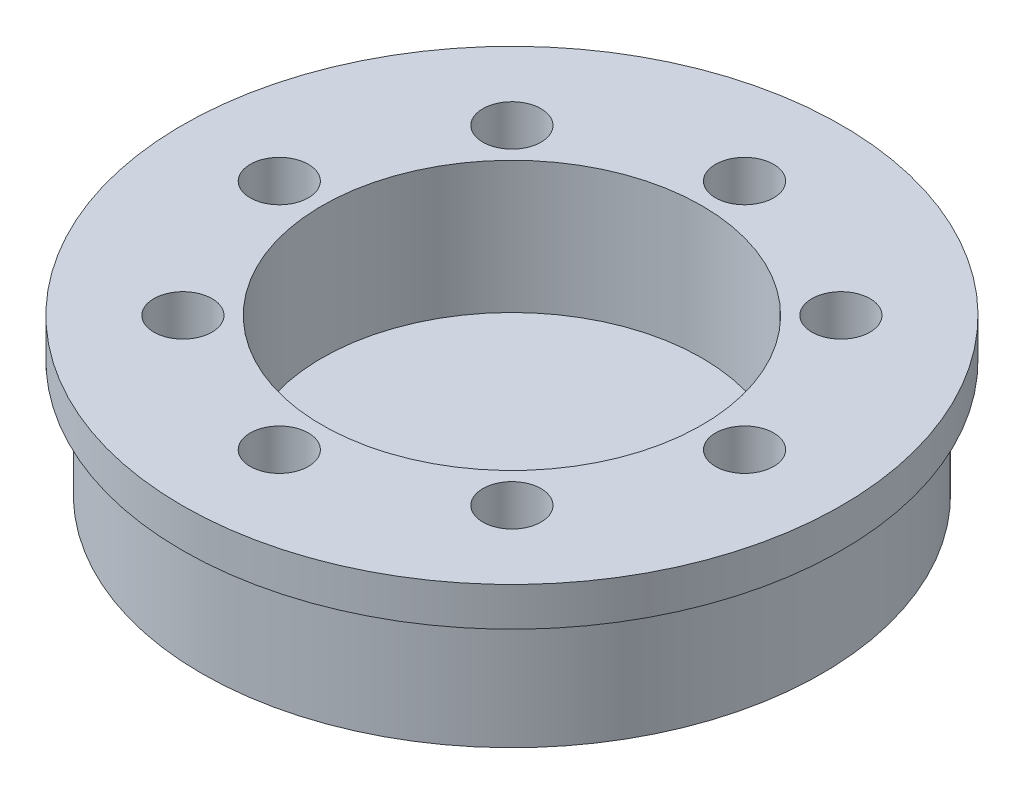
ISO-10303-21;
HEADER;
FILE_DESCRIPTION(('STEP AP214'),'2;1');
FILE_NAME('part.step','',(''),(''),'','','');
FILE_SCHEMA(('AUTOMOTIVE_DESIGN { 1 0 10303 214 1 1 1 1 }'));
ENDSEC;
DATA;
#1=APPLICATION_CONTEXT('core data for automotive mechanical design processes');
#2=APPLICATION_PROTOCOL_DEFINITION('international standard','automotive_design',2000,#1);
#3=PRODUCT_CONTEXT('',#1,'mechanical');
#4=PRODUCT('Part','Part','',(#3));
#5=PRODUCT_RELATED_PRODUCT_CATEGORY('part','',(#4));
#6=PRODUCT_DEFINITION_FORMATION('','',#4);
#7=PRODUCT_DEFINITION_CONTEXT('part definition',#1,'design');
#8=PRODUCT_DEFINITION('design','',#6,#7);
#9=PRODUCT_DEFINITION_SHAPE('','',#8);
#10=(LENGTH_UNIT() NAMED_UNIT(*) SI_UNIT(.MILLI.,.METRE.));
#11=(NAMED_UNIT(*) PLANE_ANGLE_UNIT() SI_UNIT($,.RADIAN.));
#12=(NAMED_UNIT(*) SI_UNIT($,.STERADIAN.) SOLID_ANGLE_UNIT());
#13=UNCERTAINTY_MEASURE_WITH_UNIT(LENGTH_MEASURE(1.E-05),#10,'distance_accuracy_value','');
#14=(GEOMETRIC_REPRESENTATION_CONTEXT(3) GLOBAL_UNCERTAINTY_ASSIGNED_CONTEXT((#13)) GLOBAL_UNIT_ASSIGNED_CONTEXT((#10,
#11,#12)) REPRESENTATION_CONTEXT('',''));
#15=CARTESIAN_POINT('',(0.,0.,0.));
#16=DIRECTION('',(0.,0.,1.));
#17=DIRECTION('',(1.,0.,0.));
#18=AXIS2_PLACEMENT_3D('',#15,#16,#17);
#19=CARTESIAN_POINT('',(0.,19.05,0.));
#20=DIRECTION('',(0.,-1.,0.));
#21=DIRECTION('',(0.,0.,-1.));
#22=AXIS2_PLACEMENT_3D('',#19,#20,#21);
#23=CYLINDRICAL_SURFACE('',#22,31.115);
#24=CARTESIAN_POINT('',(0.,3.81,0.));
#25=DIRECTION('',(0.,-1.,0.));
#26=DIRECTION('',(0.,0.,-1.));
#27=AXIS2_PLACEMENT_3D('',#24,#25,#26);
#28=CIRCLE('',#27,31.115);
#29=CARTESIAN_POINT('',(0.,3.81,-31.115));
#30=VERTEX_POINT('',#29);
#31=EDGE_CURVE('E47',#30,#30,#28,.T.);
#32=CARTESIAN_POINT('',(0.,25.4,0.));
#33=DIRECTION('',(0.,1.,0.));
#34=DIRECTION('',(0.,0.,1.));
#35=AXIS2_PLACEMENT_3D('',#32,#33,#34);
#36=CIRCLE('',#35,31.115);
#37=CARTESIAN_POINT('',(0.,25.4,-31.115));
#38=VERTEX_POINT('',#37);
#39=EDGE_CURVE('E132',#38,#38,#36,.F.);
#40=CARTESIAN_POINT('',(0.,3.81,-31.115));
#41=CARTESIAN_POINT('',(0.,4.03489583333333,-31.115));
#42=CARTESIAN_POINT('',(0.,4.25979166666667,-31.115));
#43=CARTESIAN_POINT('',(0.,4.70958333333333,-31.115));
#44=CARTESIAN_POINT('',(0.,4.93447916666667,-31.115));
#45=CARTESIAN_POINT('',(0.,5.38427083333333,-31.115));
#46=CARTESIAN_POINT('',(0.,5.60916666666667,-31.115));
#47=CARTESIAN_POINT('',(0.,6.05895833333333,-31.115));
#48=CARTESIAN_POINT('',(0.,6.28385416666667,-31.115));
#49=CARTESIAN_POINT('',(0.,6.73364583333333,-31.115));
#50=CARTESIAN_POINT('',(0.,6.95854166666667,-31.115));
#51=CARTESIAN_POINT('',(0.,7.40833333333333,-31.115));
#52=CARTESIAN_POINT('',(0.,7.63322916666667,-31.115));
#53=CARTESIAN_POINT('',(0.,8.08302083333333,-31.115));
#54=CARTESIAN_POINT('',(0.,8.30791666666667,-31.115));
#55=CARTESIAN_POINT('',(0.,8.75770833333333,-31.115));
#56=CARTESIAN_POINT('',(0.,8.98260416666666,-31.115));
#57=CARTESIAN_POINT('',(0.,9.43239583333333,-31.115));
#58=CARTESIAN_POINT('',(0.,9.65729166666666,-31.115));
#59=CARTESIAN_POINT('',(0.,10.1070833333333,-31.115));
#60=CARTESIAN_POINT('',(0.,10.3319791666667,-31.115));
#61=CARTESIAN_POINT('',(0.,10.7817708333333,-31.115));
#62=CARTESIAN_POINT('',(0.,11.0066666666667,-31.115));
#63=CARTESIAN_POINT('',(0.,11.4564583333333,-31.115));
#64=CARTESIAN_POINT('',(0.,11.6813541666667,-31.115));
#65=CARTESIAN_POINT('',(0.,12.1311458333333,-31.115));
#66=CARTESIAN_POINT('',(0.,12.3560416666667,-31.115));
#67=CARTESIAN_POINT('',(0.,12.8058333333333,-31.115));
#68=CARTESIAN_POINT('',(0.,13.0307291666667,-31.115));
#69=CARTESIAN_POINT('',(0.,13.4805208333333,-31.115));
#70=CARTESIAN_POINT('',(0.,13.7054166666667,-31.115));
#71=CARTESIAN_POINT('',(0.,14.1552083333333,-31.115));
#72=CARTESIAN_POINT('',(0.,14.3801041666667,-31.115));
#73=CARTESIAN_POINT('',(0.,14.8298958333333,-31.115));
#74=CARTESIAN_POINT('',(0.,15.0547916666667,-31.115));
#75=CARTESIAN_POINT('',(0.,15.5045833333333,-31.115));
#76=CARTESIAN_POINT('',(0.,15.7294791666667,-31.115));
#77=CARTESIAN_POINT('',(0.,16.1792708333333,-31.115));
#78=CARTESIAN_POINT('',(0.,16.4041666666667,-31.115));
#79=CARTESIAN_POINT('',(0.,16.8539583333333,-31.115));
#80=CARTESIAN_POINT('',(0.,17.0788541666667,-31.115));
#81=CARTESIAN_POINT('',(0.,17.5286458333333,-31.115));
#82=CARTESIAN_POINT('',(0.,17.7535416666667,-31.115));
#83=CARTESIAN_POINT('',(0.,18.2033333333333,-31.115));
#84=CARTESIAN_POINT('',(0.,18.4282291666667,-31.115));
#85=CARTESIAN_POINT('',(0.,18.8780208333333,-31.115));
#86=CARTESIAN_POINT('',(0.,19.1029166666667,-31.115));
#87=CARTESIAN_POINT('',(0.,19.5527083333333,-31.115));
#88=CARTESIAN_POINT('',(0.,19.7776041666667,-31.115));
#89=CARTESIAN_POINT('',(0.,20.2273958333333,-31.115));
#90=CARTESIAN_POINT('',(0.,20.4522916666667,-31.115));
#91=CARTESIAN_POINT('',(0.,20.9020833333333,-31.115));
#92=CARTESIAN_POINT('',(0.,21.1269791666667,-31.115));
#93=CARTESIAN_POINT('',(0.,21.5767708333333,-31.115));
#94=CARTESIAN_POINT('',(0.,21.8016666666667,-31.115));
#95=CARTESIAN_POINT('',(0.,22.2514583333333,-31.115));
#96=CARTESIAN_POINT('',(0.,22.4763541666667,-31.115));
#97=CARTESIAN_POINT('',(0.,22.9261458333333,-31.115));
#98=CARTESIAN_POINT('',(0.,23.1510416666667,-31.115));
#99=CARTESIAN_POINT('',(0.,23.6008333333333,-31.115));
#100=CARTESIAN_POINT('',(0.,23.8257291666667,-31.115));
#101=CARTESIAN_POINT('',(0.,24.2755208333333,-31.115));
#102=CARTESIAN_POINT('',(0.,24.5004166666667,-31.115));
#103=CARTESIAN_POINT('',(0.,24.9502083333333,-31.115));
#104=CARTESIAN_POINT('',(0.,25.1751041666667,-31.115));
#105=CARTESIAN_POINT('',(0.,25.4,-31.115));
#106=B_SPLINE_CURVE_WITH_KNOTS('',3,(#40,#41,#42,#43,#44,#45,#46,#47,#48,#49,#50,#51,#52,#53,
#54,#55,#56,#57,#58,#59,#60,#61,#62,#63,#64,#65,#66,#67,#68,#69,#70,#71,#72,#73,#74,#75,#76,#77,
#78,#79,#80,#81,#82,#83,#84,#85,#86,#87,#88,#89,#90,#91,#92,#93,#94,#95,#96,#97,#98,#99,#100,
#101,#102,#103,#104,#105),.UNSPECIFIED.,.F.,.F.,(4,2,2,2,2,2,2,2,2,2,2,2,2,2,2,2,2,2,2,2,2,2,2,
2,2,2,2,2,2,2,2,2,4),(0.,0.6746875,1.349375,2.0240625,2.69875,3.3734375,4.048125,4.7228125,
5.3975,6.0721875,6.746875,7.4215625,8.09625,8.7709375,9.445625,10.1203125,10.795,11.4696875,
12.144375,12.8190625,13.49375,14.1684375,14.843125,15.5178125,16.1925,16.8671875,17.541875,
18.2165625,18.89125,19.5659375,20.240625,20.9153125,21.59),.UNSPECIFIED.);
#107=EDGE_CURVE('BSEAM43',#30,#38,#106,.T.);
#108=ORIENTED_EDGE('',*,*,#31,.T.);
#109=ORIENTED_EDGE('',*,*,#39,.F.);
#110=ORIENTED_EDGE('',*,*,#107,.T.);
#111=ORIENTED_EDGE('',*,*,#107,.F.);
#112=EDGE_LOOP('',(#108,#110,#109,#111));
#113=FACE_BOUND('',#112,.T.);
#114=ADVANCED_FACE('F43',(#113),#23,.F.);
#115=CARTESIAN_POINT('',(0.,3.81,0.));
#116=DIRECTION('',(0.,-1.,0.));
#117=DIRECTION('',(0.,0.,-1.));
#118=AXIS2_PLACEMENT_3D('',#115,#116,#117);
#119=PLANE('',#118);
#120=ORIENTED_EDGE('',*,*,#31,.F.);
#121=EDGE_LOOP('',(#120));
#122=FACE_BOUND('',#121,.T.);
#123=ADVANCED_FACE('F143',(#122),#119,.F.);
#124=CARTESIAN_POINT('',(0.,25.4,0.));
#125=DIRECTION('',(0.,-1.,0.));
#126=DIRECTION('',(0.,0.,-1.));
#127=AXIS2_PLACEMENT_3D('',#124,#125,#126);
#128=CYLINDRICAL_SURFACE('',#127,53.975);
#129=CARTESIAN_POINT('',(0.,25.4,0.));
#130=DIRECTION('',(0.,1.,0.));
#131=DIRECTION('',(0.,0.,1.));
#132=AXIS2_PLACEMENT_3D('',#129,#130,#131);
#133=CIRCLE('',#132,53.975);
#134=CARTESIAN_POINT('',(0.,25.4,53.975));
#135=VERTEX_POINT('',#134);
#136=EDGE_CURVE('E125',#135,#135,#133,.T.);
#137=ORIENTED_EDGE('',*,*,#136,.F.);
#138=EDGE_LOOP('',(#137));
#139=FACE_BOUND('',#138,.T.);
#140=CARTESIAN_POINT('',(0.,19.05,0.));
#141=DIRECTION('',(0.,1.,0.));
#142=DIRECTION('',(0.,0.,1.));
#143=AXIS2_PLACEMENT_3D('',#140,#141,#142);
#144=CIRCLE('',#143,53.975);
#145=CARTESIAN_POINT('',(0.,19.05,53.975));
#146=VERTEX_POINT('',#145);
#147=EDGE_CURVE('E61',#146,#146,#144,.T.);
#148=ORIENTED_EDGE('',*,*,#147,.T.);
#149=EDGE_LOOP('',(#148));
#150=FACE_BOUND('',#149,.T.);
#151=ADVANCED_FACE('F145',(#139,#150),#128,.T.);
#152=CARTESIAN_POINT('',(0.,25.4,0.));
#153=DIRECTION('',(0.,1.,0.));
#154=DIRECTION('',(0.,0.,1.));
#155=AXIS2_PLACEMENT_3D('',#152,#153,#154);
#156=PLANE('',#155);
#157=CARTESIAN_POINT('',(26.9407683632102,25.4,26.9407683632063));
#158=DIRECTION('',(0.,1.,0.));
#159=DIRECTION('',(0.,0.,1.));
#160=AXIS2_PLACEMENT_3D('',#157,#158,#159);
#161=CIRCLE('',#160,4.7625000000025);
#162=CARTESIAN_POINT('',(26.9407683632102,25.4,22.1782683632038));
#163=VERTEX_POINT('',#162);
#164=EDGE_CURVE('E198',#163,#163,#161,.F.);
#165=ORIENTED_EDGE('',*,*,#164,.T.);
#166=EDGE_LOOP('',(#165));
#167=FACE_BOUND('',#166,.T.);
#168=CARTESIAN_POINT('',(3.23460367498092E-12,25.4,38.1));
#169=DIRECTION('',(0.,1.,0.));
#170=DIRECTION('',(0.,0.,1.));
#171=AXIS2_PLACEMENT_3D('',#168,#169,#170);
#172=CIRCLE('',#171,4.76250000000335);
#173=CARTESIAN_POINT('',(3.23460367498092E-12,25.4,33.3374999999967));
#174=VERTEX_POINT('',#173);
#175=EDGE_CURVE('E195',#174,#174,#172,.F.);
#176=ORIENTED_EDGE('',*,*,#175,.T.);
#177=EDGE_LOOP('',(#176));
#178=FACE_BOUND('',#177,.T.);
#179=CARTESIAN_POINT('',(-26.9407683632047,25.4,26.9407683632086));
#180=DIRECTION('',(0.,1.,0.));
#181=DIRECTION('',(0.,0.,1.));
#182=AXIS2_PLACEMENT_3D('',#179,#180,#181);
#183=CIRCLE('',#182,4.76250000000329);
#184=CARTESIAN_POINT('',(-26.9407683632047,25.4,22.1782683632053));
#185=VERTEX_POINT('',#184);
#186=EDGE_CURVE('E118',#185,#185,#183,.F.);
#187=ORIENTED_EDGE('',*,*,#186,.T.);
#188=EDGE_LOOP('',(#187));
#189=FACE_BOUND('',#188,.T.);
#190=CARTESIAN_POINT('',(-38.0999999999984,25.4,1.62196774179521E-12));
#191=DIRECTION('',(0.,1.,0.));
#192=DIRECTION('',(0.,0.,1.));
#193=AXIS2_PLACEMENT_3D('',#190,#191,#192);
#194=CIRCLE('',#193,4.76250000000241);
#195=CARTESIAN_POINT('',(-38.0999999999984,25.4,-4.76250000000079));
#196=VERTEX_POINT('',#195);
#197=EDGE_CURVE('E110',#196,#196,#194,.F.);
#198=ORIENTED_EDGE('',*,*,#197,.T.);
#199=EDGE_LOOP('',(#198));
#200=FACE_BOUND('',#199,.T.);
#201=CARTESIAN_POINT('',(-26.940768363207,25.4,-26.9407683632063));
#202=DIRECTION('',(0.,1.,0.));
#203=DIRECTION('',(0.,0.,1.));
#204=AXIS2_PLACEMENT_3D('',#201,#202,#203);
#205=CIRCLE('',#204,4.76250000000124);
#206=CARTESIAN_POINT('',(-26.940768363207,25.4,-31.7032683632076));
#207=VERTEX_POINT('',#206);
#208=EDGE_CURVE('E106',#207,#207,#205,.F.);
#209=ORIENTED_EDGE('',*,*,#208,.T.);
#210=EDGE_LOOP('',(#209));
#211=FACE_BOUND('',#210,.T.);
#212=CARTESIAN_POINT('',(0.,25.4,-38.1));
#213=DIRECTION('',(0.,1.,0.));
#214=DIRECTION('',(0.,0.,1.));
#215=AXIS2_PLACEMENT_3D('',#212,#213,#214);
#216=CIRCLE('',#215,4.7625);
#217=CARTESIAN_POINT('',(0.,25.4,-42.8625));
#218=VERTEX_POINT('',#217);
#219=EDGE_CURVE('E109',#218,#218,#216,.F.);
#220=ORIENTED_EDGE('',*,*,#219,.T.);
#221=EDGE_LOOP('',(#220));
#222=FACE_BOUND('',#221,.T.);
#223=CARTESIAN_POINT('',(26.9407683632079,25.4,-26.9407683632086));
#224=DIRECTION('',(0.,1.,0.));
#225=DIRECTION('',(0.,0.,1.));
#226=AXIS2_PLACEMENT_3D('',#223,#224,#225);
#227=CIRCLE('',#226,4.76250000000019);
#228=CARTESIAN_POINT('',(26.9407683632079,25.4,-31.7032683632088));
#229=VERTEX_POINT('',#228);
#230=EDGE_CURVE('E115',#229,#229,#227,.F.);
#231=ORIENTED_EDGE('',*,*,#230,.T.);
#232=EDGE_LOOP('',(#231));
#233=FACE_BOUND('',#232,.T.);
#234=ORIENTED_EDGE('',*,*,#136,.T.);
#235=EDGE_LOOP('',(#234));
#236=FACE_BOUND('',#235,.T.);
#237=CARTESIAN_POINT('',(38.1000000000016,25.4,-1.61730183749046E-12));
#238=DIRECTION('',(0.,1.,0.));
#239=DIRECTION('',(0.,0.,1.));
#240=AXIS2_PLACEMENT_3D('',#237,#238,#239);
#241=CIRCLE('',#240,4.7625000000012);
#242=CARTESIAN_POINT('',(38.1000000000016,25.4,-4.76250000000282));
#243=VERTEX_POINT('',#242);
#244=EDGE_CURVE('E129',#243,#243,#241,.F.);
#245=ORIENTED_EDGE('',*,*,#244,.T.);
#246=EDGE_LOOP('',(#245));
#247=FACE_BOUND('',#246,.T.);
#248=ORIENTED_EDGE('',*,*,#39,.T.);
#249=EDGE_LOOP('',(#248));
#250=FACE_BOUND('',#249,.T.);
#251=ADVANCED_FACE('F151',(#167,#178,#189,#200,#211,#222,#233,#236,#247,#250),#156,.T.);
#252=CARTESIAN_POINT('',(0.,19.05,0.));
#253=DIRECTION('',(0.,1.,0.));
#254=DIRECTION('',(0.,0.,1.));
#255=AXIS2_PLACEMENT_3D('',#252,#253,#254);
#256=PLANE('',#255);
#257=CARTESIAN_POINT('',(0.,19.05,0.));
#258=DIRECTION('',(0.,1.,0.));
#259=DIRECTION('',(0.,0.,1.));
#260=AXIS2_PLACEMENT_3D('',#257,#258,#259);
#261=CIRCLE('',#260,50.8);
#262=CARTESIAN_POINT('',(0.,19.05,-50.8));
#263=VERTEX_POINT('',#262);
#264=EDGE_CURVE('E10',#263,#263,#261,.T.);
#265=ORIENTED_EDGE('',*,*,#264,.T.);
#266=EDGE_LOOP('',(#265));
#267=FACE_BOUND('',#266,.T.);
#268=ORIENTED_EDGE('',*,*,#147,.F.);
#269=EDGE_LOOP('',(#268));
#270=FACE_BOUND('',#269,.T.);
#271=ADVANCED_FACE('F102',(#267,#270),#256,.F.);
#272=CARTESIAN_POINT('',(-26.940768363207,19.05,-26.9407683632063));
#273=DIRECTION('',(0.,-1.,0.));
#274=DIRECTION('',(0.,0.,-1.));
#275=AXIS2_PLACEMENT_3D('',#272,#273,#274);
#276=CYLINDRICAL_SURFACE('',#275,4.76250000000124);
#277=CARTESIAN_POINT('',(-26.940768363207,0.,-26.9407683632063));
#278=DIRECTION('',(0.,1.,0.));
#279=DIRECTION('',(0.,0.,1.));
#280=AXIS2_PLACEMENT_3D('',#277,#278,#279);
#281=CIRCLE('',#280,4.76250000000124);
#282=CARTESIAN_POINT('',(-26.940768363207,0.,-31.7032683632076));
#283=VERTEX_POINT('',#282);
#284=EDGE_CURVE('E58',#283,#283,#281,.T.);
#285=CARTESIAN_POINT('',(-26.940768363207,0.,-31.7032683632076));
#286=CARTESIAN_POINT('',(-26.940768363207,0.264583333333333,-31.7032683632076));
#287=CARTESIAN_POINT('',(-26.940768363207,0.529166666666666,-31.7032683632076));
#288=CARTESIAN_POINT('',(-26.940768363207,1.05833333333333,-31.7032683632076));
#289=CARTESIAN_POINT('',(-26.940768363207,1.32291666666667,-31.7032683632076));
#290=CARTESIAN_POINT('',(-26.940768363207,1.85208333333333,-31.7032683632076));
#291=CARTESIAN_POINT('',(-26.940768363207,2.11666666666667,-31.7032683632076));
#292=CARTESIAN_POINT('',(-26.940768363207,2.64583333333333,-31.7032683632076));
#293=CARTESIAN_POINT('',(-26.940768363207,2.91041666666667,-31.7032683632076));
#294=CARTESIAN_POINT('',(-26.940768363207,3.43958333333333,-31.7032683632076));
#295=CARTESIAN_POINT('',(-26.940768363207,3.70416666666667,-31.7032683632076));
#296=CARTESIAN_POINT('',(-26.940768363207,4.23333333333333,-31.7032683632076));
#297=CARTESIAN_POINT('',(-26.940768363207,4.49791666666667,-31.7032683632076));
#298=CARTESIAN_POINT('',(-26.940768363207,5.02708333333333,-31.7032683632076));
#299=CARTESIAN_POINT('',(-26.940768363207,5.29166666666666,-31.7032683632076));
#300=CARTESIAN_POINT('',(-26.940768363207,5.82083333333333,-31.7032683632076));
#301=CARTESIAN_POINT('',(-26.940768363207,6.08541666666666,-31.7032683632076));
#302=CARTESIAN_POINT('',(-26.940768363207,6.61458333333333,-31.7032683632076));
#303=CARTESIAN_POINT('',(-26.940768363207,6.87916666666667,-31.7032683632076));
#304=CARTESIAN_POINT('',(-26.940768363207,7.40833333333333,-31.7032683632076));
#305=CARTESIAN_POINT('',(-26.940768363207,7.67291666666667,-31.7032683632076));
#306=CARTESIAN_POINT('',(-26.940768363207,8.20208333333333,-31.7032683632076));
#307=CARTESIAN_POINT('',(-26.940768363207,8.46666666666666,-31.7032683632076));
#308=CARTESIAN_POINT('',(-26.940768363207,8.99583333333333,-31.7032683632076));
#309=CARTESIAN_POINT('',(-26.940768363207,9.26041666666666,-31.7032683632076));
#310=CARTESIAN_POINT('',(-26.940768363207,9.78958333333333,-31.7032683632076));
#311=CARTESIAN_POINT('',(-26.940768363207,10.0541666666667,-31.7032683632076));
#312=CARTESIAN_POINT('',(-26.940768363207,10.5833333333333,-31.7032683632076));
#313=CARTESIAN_POINT('',(-26.940768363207,10.8479166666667,-31.7032683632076));
#314=CARTESIAN_POINT('',(-26.940768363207,11.3770833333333,-31.7032683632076));
#315=CARTESIAN_POINT('',(-26.940768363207,11.6416666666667,-31.7032683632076));
#316=CARTESIAN_POINT('',(-26.940768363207,12.1708333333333,-31.7032683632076));
#317=CARTESIAN_POINT('',(-26.940768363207,12.4354166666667,-31.7032683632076));
#318=CARTESIAN_POINT('',(-26.940768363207,12.9645833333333,-31.7032683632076));
#319=CARTESIAN_POINT('',(-26.940768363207,13.2291666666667,-31.7032683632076));
#320=CARTESIAN_POINT('',(-26.940768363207,13.7583333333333,-31.7032683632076));
#321=CARTESIAN_POINT('',(-26.940768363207,14.0229166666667,-31.7032683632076));
#322=CARTESIAN_POINT('',(-26.940768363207,14.5520833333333,-31.7032683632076));
#323=CARTESIAN_POINT('',(-26.940768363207,14.8166666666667,-31.7032683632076));
#324=CARTESIAN_POINT('',(-26.940768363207,15.3458333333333,-31.7032683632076));
#325=CARTESIAN_POINT('',(-26.940768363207,15.6104166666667,-31.7032683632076));
#326=CARTESIAN_POINT('',(-26.940768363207,16.1395833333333,-31.7032683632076));
#327=CARTESIAN_POINT('',(-26.940768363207,16.4041666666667,-31.7032683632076));
#328=CARTESIAN_POINT('',(-26.940768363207,16.9333333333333,-31.7032683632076));
#329=CARTESIAN_POINT('',(-26.940768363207,17.1979166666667,-31.7032683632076));
#330=CARTESIAN_POINT('',(-26.940768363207,17.7270833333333,-31.7032683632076));
#331=CARTESIAN_POINT('',(-26.940768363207,17.9916666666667,-31.7032683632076));
#332=CARTESIAN_POINT('',(-26.940768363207,18.5208333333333,-31.7032683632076));
#333=CARTESIAN_POINT('',(-26.940768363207,18.7854166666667,-31.7032683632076));
#334=CARTESIAN_POINT('',(-26.940768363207,19.3145833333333,-31.7032683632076));
#335=CARTESIAN_POINT('',(-26.940768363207,19.5791666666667,-31.7032683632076));
#336=CARTESIAN_POINT('',(-26.940768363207,20.1083333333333,-31.7032683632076));
#337=CARTESIAN_POINT('',(-26.940768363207,20.3729166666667,-31.7032683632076));
#338=CARTESIAN_POINT('',(-26.940768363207,20.9020833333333,-31.7032683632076));
#339=CARTESIAN_POINT('',(-26.940768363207,21.1666666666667,-31.7032683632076));
#340=CARTESIAN_POINT('',(-26.940768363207,21.6958333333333,-31.7032683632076));
#341=CARTESIAN_POINT('',(-26.940768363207,21.9604166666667,-31.7032683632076));
#342=CARTESIAN_POINT('',(-26.940768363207,22.4895833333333,-31.7032683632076));
#343=CARTESIAN_POINT('',(-26.940768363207,22.7541666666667,-31.7032683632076));
#344=CARTESIAN_POINT('',(-26.940768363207,23.2833333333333,-31.7032683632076));
#345=CARTESIAN_POINT('',(-26.940768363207,23.5479166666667,-31.7032683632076));
#346=CARTESIAN_POINT('',(-26.940768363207,24.0770833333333,-31.7032683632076));
#347=CARTESIAN_POINT('',(-26.940768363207,24.3416666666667,-31.7032683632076));
#348=CARTESIAN_POINT('',(-26.940768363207,24.8708333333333,-31.7032683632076));
#349=CARTESIAN_POINT('',(-26.940768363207,25.1354166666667,-31.7032683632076));
#350=CARTESIAN_POINT('',(-26.940768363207,25.4,-31.7032683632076));
#351=B_SPLINE_CURVE_WITH_KNOTS('',3,(#285,#286,#287,#288,#289,#290,#291,#292,#293,#294,#295,
#296,#297,#298,#299,#300,#301,#302,#303,#304,#305,#306,#307,#308,#309,#310,#311,#312,#313,#314,
#315,#316,#317,#318,#319,#320,#321,#322,#323,#324,#325,#326,#327,#328,#329,#330,#331,#332,#333,
#334,#335,#336,#337,#338,#339,#340,#341,#342,#343,#344,#345,#346,#347,#348,#349,#350),
.UNSPECIFIED.,.F.,.F.,(4,2,2,2,2,2,2,2,2,2,2,2,2,2,2,2,2,2,2,2,2,2,2,2,2,2,2,2,2,2,2,2,4),(0.,
0.793749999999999,1.5875,2.38125,3.175,3.96875,4.7625,5.55625,6.35,7.14375,7.9375,8.73125,9.525,
10.31875,11.1125,11.90625,12.7,13.49375,14.2875,15.08125,15.875,16.66875,17.4625,18.25625,19.05,
19.84375,20.6375,21.43125,22.225,23.01875,23.8125,24.60625,25.4),.UNSPECIFIED.);
#352=EDGE_CURVE('BSEAM98',#283,#207,#351,.T.);
#353=ORIENTED_EDGE('',*,*,#284,.F.);
#354=ORIENTED_EDGE('',*,*,#208,.F.);
#355=ORIENTED_EDGE('',*,*,#352,.T.);
#356=ORIENTED_EDGE('',*,*,#352,.F.);
#357=EDGE_LOOP('',(#353,#355,#354,#356));
#358=FACE_BOUND('',#357,.T.);
#359=ADVANCED_FACE('F98',(#358),#276,.F.);
#360=CARTESIAN_POINT('',(0.,19.05,-38.1));
#361=DIRECTION('',(0.,-1.,0.));
#362=DIRECTION('',(0.,0.,-1.));
#363=AXIS2_PLACEMENT_3D('',#360,#361,#362);
#364=CYLINDRICAL_SURFACE('',#363,4.7625);
#365=CARTESIAN_POINT('',(0.,0.,-38.1));
#366=DIRECTION('',(0.,1.,0.));
#367=DIRECTION('',(0.,0.,1.));
#368=AXIS2_PLACEMENT_3D('',#365,#366,#367);
#369=CIRCLE('',#368,4.7625);
#370=CARTESIAN_POINT('',(0.,0.,-42.8625));
#371=VERTEX_POINT('',#370);
#372=EDGE_CURVE('E87',#371,#371,#369,.T.);
#373=CARTESIAN_POINT('',(0.,0.,-42.8625));
#374=CARTESIAN_POINT('',(0.,0.264583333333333,-42.8625));
#375=CARTESIAN_POINT('',(0.,0.529166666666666,-42.8625));
#376=CARTESIAN_POINT('',(0.,1.05833333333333,-42.8625));
#377=CARTESIAN_POINT('',(0.,1.32291666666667,-42.8625));
#378=CARTESIAN_POINT('',(0.,1.85208333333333,-42.8625));
#379=CARTESIAN_POINT('',(0.,2.11666666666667,-42.8625));
#380=CARTESIAN_POINT('',(0.,2.64583333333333,-42.8625));
#381=CARTESIAN_POINT('',(0.,2.91041666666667,-42.8625));
#382=CARTESIAN_POINT('',(0.,3.43958333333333,-42.8625));
#383=CARTESIAN_POINT('',(0.,3.70416666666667,-42.8625));
#384=CARTESIAN_POINT('',(0.,4.23333333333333,-42.8625));
#385=CARTESIAN_POINT('',(0.,4.49791666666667,-42.8625));
#386=CARTESIAN_POINT('',(0.,5.02708333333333,-42.8625));
#387=CARTESIAN_POINT('',(0.,5.29166666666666,-42.8625));
#388=CARTESIAN_POINT('',(0.,5.82083333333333,-42.8625));
#389=CARTESIAN_POINT('',(0.,6.08541666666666,-42.8625));
#390=CARTESIAN_POINT('',(0.,6.61458333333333,-42.8625));
#391=CARTESIAN_POINT('',(0.,6.87916666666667,-42.8625));
#392=CARTESIAN_POINT('',(0.,7.40833333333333,-42.8625));
#393=CARTESIAN_POINT('',(0.,7.67291666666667,-42.8625));
#394=CARTESIAN_POINT('',(0.,8.20208333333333,-42.8625));
#395=CARTESIAN_POINT('',(0.,8.46666666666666,-42.8625));
#396=CARTESIAN_POINT('',(0.,8.99583333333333,-42.8625));
#397=CARTESIAN_POINT('',(0.,9.26041666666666,-42.8625));
#398=CARTESIAN_POINT('',(0.,9.78958333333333,-42.8625));
#399=CARTESIAN_POINT('',(0.,10.0541666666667,-42.8625));
#400=CARTESIAN_POINT('',(0.,10.5833333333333,-42.8625));
#401=CARTESIAN_POINT('',(0.,10.8479166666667,-42.8625));
#402=CARTESIAN_POINT('',(0.,11.3770833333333,-42.8625));
#403=CARTESIAN_POINT('',(0.,11.6416666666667,-42.8625));
#404=CARTESIAN_POINT('',(0.,12.1708333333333,-42.8625));
#405=CARTESIAN_POINT('',(0.,12.4354166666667,-42.8625));
#406=CARTESIAN_POINT('',(0.,12.9645833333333,-42.8625));
#407=CARTESIAN_POINT('',(0.,13.2291666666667,-42.8625));
#408=CARTESIAN_POINT('',(0.,13.7583333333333,-42.8625));
#409=CARTESIAN_POINT('',(0.,14.0229166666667,-42.8625));
#410=CARTESIAN_POINT('',(0.,14.5520833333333,-42.8625));
#411=CARTESIAN_POINT('',(0.,14.8166666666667,-42.8625));
#412=CARTESIAN_POINT('',(0.,15.3458333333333,-42.8625));
#413=CARTESIAN_POINT('',(0.,15.6104166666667,-42.8625));
#414=CARTESIAN_POINT('',(0.,16.1395833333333,-42.8625));
#415=CARTESIAN_POINT('',(0.,16.4041666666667,-42.8625));
#416=CARTESIAN_POINT('',(0.,16.9333333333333,-42.8625));
#417=CARTESIAN_POINT('',(0.,17.1979166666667,-42.8625));
#418=CARTESIAN_POINT('',(0.,17.7270833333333,-42.8625));
#419=CARTESIAN_POINT('',(0.,17.9916666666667,-42.8625));
#420=CARTESIAN_POINT('',(0.,18.5208333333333,-42.8625));
#421=CARTESIAN_POINT('',(0.,18.7854166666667,-42.8625));
#422=CARTESIAN_POINT('',(0.,19.3145833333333,-42.8625));
#423=CARTESIAN_POINT('',(0.,19.5791666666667,-42.8625));
#424=CARTESIAN_POINT('',(0.,20.1083333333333,-42.8625));
#425=CARTESIAN_POINT('',(0.,20.3729166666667,-42.8625));
#426=CARTESIAN_POINT('',(0.,20.9020833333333,-42.8625));
#427=CARTESIAN_POINT('',(0.,21.1666666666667,-42.8625));
#428=CARTESIAN_POINT('',(0.,21.6958333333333,-42.8625));
#429=CARTESIAN_POINT('',(0.,21.9604166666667,-42.8625));
#430=CARTESIAN_POINT('',(0.,22.4895833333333,-42.8625));
#431=CARTESIAN_POINT('',(0.,22.7541666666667,-42.8625));
#432=CARTESIAN_POINT('',(0.,23.2833333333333,-42.8625));
#433=CARTESIAN_POINT('',(0.,23.5479166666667,-42.8625));
#434=CARTESIAN_POINT('',(0.,24.0770833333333,-42.8625));
#435=CARTESIAN_POINT('',(0.,24.3416666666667,-42.8625));
#436=CARTESIAN_POINT('',(0.,24.8708333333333,-42.8625));
#437=CARTESIAN_POINT('',(0.,25.1354166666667,-42.8625));
#438=CARTESIAN_POINT('',(0.,25.4,-42.8625));
#439=B_SPLINE_CURVE_WITH_KNOTS('',3,(#373,#374,#375,#376,#377,#378,#379,#380,#381,#382,#383,
#384,#385,#386,#387,#388,#389,#390,#391,#392,#393,#394,#395,#396,#397,#398,#399,#400,#401,#402,
#403,#404,#405,#406,#407,#408,#409,#410,#411,#412,#413,#414,#415,#416,#417,#418,#419,#420,#421,
#422,#423,#424,#425,#426,#427,#428,#429,#430,#431,#432,#433,#434,#435,#436,#437,#438),
.UNSPECIFIED.,.F.,.F.,(4,2,2,2,2,2,2,2,2,2,2,2,2,2,2,2,2,2,2,2,2,2,2,2,2,2,2,2,2,2,2,2,4),(0.,
0.793749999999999,1.5875,2.38125,3.175,3.96875,4.7625,5.55625,6.35,7.14375,7.9375,8.73125,9.525,
10.31875,11.1125,11.90625,12.7,13.49375,14.2875,15.08125,15.875,16.66875,17.4625,18.25625,19.05,
19.84375,20.6375,21.43125,22.225,23.01875,23.8125,24.60625,25.4),.UNSPECIFIED.);
#440=EDGE_CURVE('BSEAM101',#371,#218,#439,.T.);
#441=ORIENTED_EDGE('',*,*,#372,.F.);
#442=ORIENTED_EDGE('',*,*,#219,.F.);
#443=ORIENTED_EDGE('',*,*,#440,.T.);
#444=ORIENTED_EDGE('',*,*,#440,.F.);
#445=EDGE_LOOP('',(#441,#443,#442,#444));
#446=FACE_BOUND('',#445,.T.);
#447=ADVANCED_FACE('F101',(#446),#364,.F.);
#448=CARTESIAN_POINT('',(26.9407683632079,19.05,-26.9407683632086));
#449=DIRECTION('',(0.,-1.,0.));
#450=DIRECTION('',(0.,0.,-1.));
#451=AXIS2_PLACEMENT_3D('',#448,#449,#450);
#452=CYLINDRICAL_SURFACE('',#451,4.76250000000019);
#453=CARTESIAN_POINT('',(26.9407683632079,0.,-26.9407683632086));
#454=DIRECTION('',(0.,1.,0.));
#455=DIRECTION('',(0.,0.,1.));
#456=AXIS2_PLACEMENT_3D('',#453,#454,#455);
#457=CIRCLE('',#456,4.76250000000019);
#458=CARTESIAN_POINT('',(26.9407683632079,0.,-31.7032683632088));
#459=VERTEX_POINT('',#458);
#460=EDGE_CURVE('E83',#459,#459,#457,.T.);
#461=CARTESIAN_POINT('',(26.9407683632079,0.,-31.7032683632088));
#462=CARTESIAN_POINT('',(26.9407683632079,0.264583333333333,-31.7032683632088));
#463=CARTESIAN_POINT('',(26.9407683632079,0.529166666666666,-31.7032683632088));
#464=CARTESIAN_POINT('',(26.9407683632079,1.05833333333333,-31.7032683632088));
#465=CARTESIAN_POINT('',(26.9407683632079,1.32291666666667,-31.7032683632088));
#466=CARTESIAN_POINT('',(26.9407683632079,1.85208333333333,-31.7032683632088));
#467=CARTESIAN_POINT('',(26.9407683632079,2.11666666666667,-31.7032683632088));
#468=CARTESIAN_POINT('',(26.9407683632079,2.64583333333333,-31.7032683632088));
#469=CARTESIAN_POINT('',(26.9407683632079,2.91041666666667,-31.7032683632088));
#470=CARTESIAN_POINT('',(26.9407683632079,3.43958333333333,-31.7032683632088));
#471=CARTESIAN_POINT('',(26.9407683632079,3.70416666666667,-31.7032683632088));
#472=CARTESIAN_POINT('',(26.9407683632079,4.23333333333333,-31.7032683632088));
#473=CARTESIAN_POINT('',(26.9407683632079,4.49791666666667,-31.7032683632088));
#474=CARTESIAN_POINT('',(26.9407683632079,5.02708333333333,-31.7032683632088));
#475=CARTESIAN_POINT('',(26.9407683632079,5.29166666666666,-31.7032683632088));
#476=CARTESIAN_POINT('',(26.9407683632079,5.82083333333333,-31.7032683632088));
#477=CARTESIAN_POINT('',(26.9407683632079,6.08541666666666,-31.7032683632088));
#478=CARTESIAN_POINT('',(26.9407683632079,6.61458333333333,-31.7032683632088));
#479=CARTESIAN_POINT('',(26.9407683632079,6.87916666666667,-31.7032683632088));
#480=CARTESIAN_POINT('',(26.9407683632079,7.40833333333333,-31.7032683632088));
#481=CARTESIAN_POINT('',(26.9407683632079,7.67291666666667,-31.7032683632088));
#482=CARTESIAN_POINT('',(26.9407683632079,8.20208333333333,-31.7032683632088));
#483=CARTESIAN_POINT('',(26.9407683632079,8.46666666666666,-31.7032683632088));
#484=CARTESIAN_POINT('',(26.9407683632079,8.99583333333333,-31.7032683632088));
#485=CARTESIAN_POINT('',(26.9407683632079,9.26041666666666,-31.7032683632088));
#486=CARTESIAN_POINT('',(26.9407683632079,9.78958333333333,-31.7032683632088));
#487=CARTESIAN_POINT('',(26.9407683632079,10.0541666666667,-31.7032683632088));
#488=CARTESIAN_POINT('',(26.9407683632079,10.5833333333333,-31.7032683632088));
#489=CARTESIAN_POINT('',(26.9407683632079,10.8479166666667,-31.7032683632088));
#490=CARTESIAN_POINT('',(26.9407683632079,11.3770833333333,-31.7032683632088));
#491=CARTESIAN_POINT('',(26.9407683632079,11.6416666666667,-31.7032683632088));
#492=CARTESIAN_POINT('',(26.9407683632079,12.1708333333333,-31.7032683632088));
#493=CARTESIAN_POINT('',(26.9407683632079,12.4354166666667,-31.7032683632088));
#494=CARTESIAN_POINT('',(26.9407683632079,12.9645833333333,-31.7032683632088));
#495=CARTESIAN_POINT('',(26.9407683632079,13.2291666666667,-31.7032683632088));
#496=CARTESIAN_POINT('',(26.9407683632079,13.7583333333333,-31.7032683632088));
#497=CARTESIAN_POINT('',(26.9407683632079,14.0229166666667,-31.7032683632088));
#498=CARTESIAN_POINT('',(26.9407683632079,14.5520833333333,-31.7032683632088));
#499=CARTESIAN_POINT('',(26.9407683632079,14.8166666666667,-31.7032683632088));
#500=CARTESIAN_POINT('',(26.9407683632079,15.3458333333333,-31.7032683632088));
#501=CARTESIAN_POINT('',(26.9407683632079,15.6104166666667,-31.7032683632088));
#502=CARTESIAN_POINT('',(26.9407683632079,16.1395833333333,-31.7032683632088));
#503=CARTESIAN_POINT('',(26.9407683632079,16.4041666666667,-31.7032683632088));
#504=CARTESIAN_POINT('',(26.9407683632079,16.9333333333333,-31.7032683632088));
#505=CARTESIAN_POINT('',(26.9407683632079,17.1979166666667,-31.7032683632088));
#506=CARTESIAN_POINT('',(26.9407683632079,17.7270833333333,-31.7032683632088));
#507=CARTESIAN_POINT('',(26.9407683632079,17.9916666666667,-31.7032683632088));
#508=CARTESIAN_POINT('',(26.9407683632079,18.5208333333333,-31.7032683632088));
#509=CARTESIAN_POINT('',(26.9407683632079,18.7854166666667,-31.7032683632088));
#510=CARTESIAN_POINT('',(26.9407683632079,19.3145833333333,-31.7032683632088));
#511=CARTESIAN_POINT('',(26.9407683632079,19.5791666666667,-31.7032683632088));
#512=CARTESIAN_POINT('',(26.9407683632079,20.1083333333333,-31.7032683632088));
#513=CARTESIAN_POINT('',(26.9407683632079,20.3729166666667,-31.7032683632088));
#514=CARTESIAN_POINT('',(26.9407683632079,20.9020833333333,-31.7032683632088));
#515=CARTESIAN_POINT('',(26.9407683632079,21.1666666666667,-31.7032683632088));
#516=CARTESIAN_POINT('',(26.9407683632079,21.6958333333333,-31.7032683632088));
#517=CARTESIAN_POINT('',(26.9407683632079,21.9604166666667,-31.7032683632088));
#518=CARTESIAN_POINT('',(26.9407683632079,22.4895833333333,-31.7032683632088));
#519=CARTESIAN_POINT('',(26.9407683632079,22.7541666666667,-31.7032683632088));
#520=CARTESIAN_POINT('',(26.9407683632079,23.2833333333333,-31.7032683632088));
#521=CARTESIAN_POINT('',(26.9407683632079,23.5479166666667,-31.7032683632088));
#522=CARTESIAN_POINT('',(26.9407683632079,24.0770833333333,-31.7032683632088));
#523=CARTESIAN_POINT('',(26.9407683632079,24.3416666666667,-31.7032683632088));
#524=CARTESIAN_POINT('',(26.9407683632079,24.8708333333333,-31.7032683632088));
#525=CARTESIAN_POINT('',(26.9407683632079,25.1354166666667,-31.7032683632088));
#526=CARTESIAN_POINT('',(26.9407683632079,25.4,-31.7032683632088));
#527=B_SPLINE_CURVE_WITH_KNOTS('',3,(#461,#462,#463,#464,#465,#466,#467,#468,#469,#470,#471,
#472,#473,#474,#475,#476,#477,#478,#479,#480,#481,#482,#483,#484,#485,#486,#487,#488,#489,#490,
#491,#492,#493,#494,#495,#496,#497,#498,#499,#500,#501,#502,#503,#504,#505,#506,#507,#508,#509,
#510,#511,#512,#513,#514,#515,#516,#517,#518,#519,#520,#521,#522,#523,#524,#525,#526),
.UNSPECIFIED.,.F.,.F.,(4,2,2,2,2,2,2,2,2,2,2,2,2,2,2,2,2,2,2,2,2,2,2,2,2,2,2,2,2,2,2,2,4),(0.,
0.793749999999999,1.5875,2.38125,3.175,3.96875,4.7625,5.55625,6.35,7.14375,7.9375,8.73125,9.525,
10.31875,11.1125,11.90625,12.7,13.49375,14.2875,15.08125,15.875,16.66875,17.4625,18.25625,19.05,
19.84375,20.6375,21.43125,22.225,23.01875,23.8125,24.60625,25.4),.UNSPECIFIED.);
#528=EDGE_CURVE('BSEAM166',#459,#229,#527,.T.);
#529=ORIENTED_EDGE('',*,*,#460,.F.);
#530=ORIENTED_EDGE('',*,*,#230,.F.);
#531=ORIENTED_EDGE('',*,*,#528,.T.);
#532=ORIENTED_EDGE('',*,*,#528,.F.);
#533=EDGE_LOOP('',(#529,#531,#530,#532));
#534=FACE_BOUND('',#533,.T.);
#535=ADVANCED_FACE('F166',(#534),#452,.F.);
#536=CARTESIAN_POINT('',(38.1000000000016,19.05,-1.61730183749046E-12));
#537=DIRECTION('',(0.,-1.,0.));
#538=DIRECTION('',(0.,0.,-1.));
#539=AXIS2_PLACEMENT_3D('',#536,#537,#538);
#540=CYLINDRICAL_SURFACE('',#539,4.7625000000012);
#541=CARTESIAN_POINT('',(38.1000000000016,0.,-1.61730183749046E-12));
#542=DIRECTION('',(0.,1.,0.));
#543=DIRECTION('',(0.,0.,1.));
#544=AXIS2_PLACEMENT_3D('',#541,#542,#543);
#545=CIRCLE('',#544,4.7625000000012);
#546=CARTESIAN_POINT('',(38.1000000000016,0.,-4.76250000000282));
#547=VERTEX_POINT('',#546);
#548=EDGE_CURVE('E79',#547,#547,#545,.T.);
#549=CARTESIAN_POINT('',(38.1000000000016,0.,-4.76250000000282));
#550=CARTESIAN_POINT('',(38.1000000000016,0.264583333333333,-4.76250000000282));
#551=CARTESIAN_POINT('',(38.1000000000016,0.529166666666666,-4.76250000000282));
#552=CARTESIAN_POINT('',(38.1000000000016,1.05833333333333,-4.76250000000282));
#553=CARTESIAN_POINT('',(38.1000000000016,1.32291666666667,-4.76250000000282));
#554=CARTESIAN_POINT('',(38.1000000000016,1.85208333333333,-4.76250000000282));
#555=CARTESIAN_POINT('',(38.1000000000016,2.11666666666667,-4.76250000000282));
#556=CARTESIAN_POINT('',(38.1000000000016,2.64583333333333,-4.76250000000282));
#557=CARTESIAN_POINT('',(38.1000000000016,2.91041666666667,-4.76250000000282));
#558=CARTESIAN_POINT('',(38.1000000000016,3.43958333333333,-4.76250000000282));
#559=CARTESIAN_POINT('',(38.1000000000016,3.70416666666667,-4.76250000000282));
#560=CARTESIAN_POINT('',(38.1000000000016,4.23333333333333,-4.76250000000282));
#561=CARTESIAN_POINT('',(38.1000000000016,4.49791666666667,-4.76250000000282));
#562=CARTESIAN_POINT('',(38.1000000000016,5.02708333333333,-4.76250000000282));
#563=CARTESIAN_POINT('',(38.1000000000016,5.29166666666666,-4.76250000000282));
#564=CARTESIAN_POINT('',(38.1000000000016,5.82083333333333,-4.76250000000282));
#565=CARTESIAN_POINT('',(38.1000000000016,6.08541666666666,-4.76250000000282));
#566=CARTESIAN_POINT('',(38.1000000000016,6.61458333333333,-4.76250000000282));
#567=CARTESIAN_POINT('',(38.1000000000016,6.87916666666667,-4.76250000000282));
#568=CARTESIAN_POINT('',(38.1000000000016,7.40833333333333,-4.76250000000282));
#569=CARTESIAN_POINT('',(38.1000000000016,7.67291666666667,-4.76250000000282));
#570=CARTESIAN_POINT('',(38.1000000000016,8.20208333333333,-4.76250000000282));
#571=CARTESIAN_POINT('',(38.1000000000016,8.46666666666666,-4.76250000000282));
#572=CARTESIAN_POINT('',(38.1000000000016,8.99583333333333,-4.76250000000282));
#573=CARTESIAN_POINT('',(38.1000000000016,9.26041666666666,-4.76250000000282));
#574=CARTESIAN_POINT('',(38.1000000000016,9.78958333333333,-4.76250000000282));
#575=CARTESIAN_POINT('',(38.1000000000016,10.0541666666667,-4.76250000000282));
#576=CARTESIAN_POINT('',(38.1000000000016,10.5833333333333,-4.76250000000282));
#577=CARTESIAN_POINT('',(38.1000000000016,10.8479166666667,-4.76250000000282));
#578=CARTESIAN_POINT('',(38.1000000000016,11.3770833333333,-4.76250000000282));
#579=CARTESIAN_POINT('',(38.1000000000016,11.6416666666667,-4.76250000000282));
#580=CARTESIAN_POINT('',(38.1000000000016,12.1708333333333,-4.76250000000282));
#581=CARTESIAN_POINT('',(38.1000000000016,12.4354166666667,-4.76250000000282));
#582=CARTESIAN_POINT('',(38.1000000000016,12.9645833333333,-4.76250000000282));
#583=CARTESIAN_POINT('',(38.1000000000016,13.2291666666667,-4.76250000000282));
#584=CARTESIAN_POINT('',(38.1000000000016,13.7583333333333,-4.76250000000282));
#585=CARTESIAN_POINT('',(38.1000000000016,14.0229166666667,-4.76250000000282));
#586=CARTESIAN_POINT('',(38.1000000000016,14.5520833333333,-4.76250000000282));
#587=CARTESIAN_POINT('',(38.1000000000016,14.8166666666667,-4.76250000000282));
#588=CARTESIAN_POINT('',(38.1000000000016,15.3458333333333,-4.76250000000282));
#589=CARTESIAN_POINT('',(38.1000000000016,15.6104166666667,-4.76250000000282));
#590=CARTESIAN_POINT('',(38.1000000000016,16.1395833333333,-4.76250000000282));
#591=CARTESIAN_POINT('',(38.1000000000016,16.4041666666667,-4.76250000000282));
#592=CARTESIAN_POINT('',(38.1000000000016,16.9333333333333,-4.76250000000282));
#593=CARTESIAN_POINT('',(38.1000000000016,17.1979166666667,-4.76250000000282));
#594=CARTESIAN_POINT('',(38.1000000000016,17.7270833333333,-4.76250000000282));
#595=CARTESIAN_POINT('',(38.1000000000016,17.9916666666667,-4.76250000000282));
#596=CARTESIAN_POINT('',(38.1000000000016,18.5208333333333,-4.76250000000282));
#597=CARTESIAN_POINT('',(38.1000000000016,18.7854166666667,-4.76250000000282));
#598=CARTESIAN_POINT('',(38.1000000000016,19.3145833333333,-4.76250000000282));
#599=CARTESIAN_POINT('',(38.1000000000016,19.5791666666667,-4.76250000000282));
#600=CARTESIAN_POINT('',(38.1000000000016,20.1083333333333,-4.76250000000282));
#601=CARTESIAN_POINT('',(38.1000000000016,20.3729166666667,-4.76250000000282));
#602=CARTESIAN_POINT('',(38.1000000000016,20.9020833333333,-4.76250000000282));
#603=CARTESIAN_POINT('',(38.1000000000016,21.1666666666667,-4.76250000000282));
#604=CARTESIAN_POINT('',(38.1000000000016,21.6958333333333,-4.76250000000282));
#605=CARTESIAN_POINT('',(38.1000000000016,21.9604166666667,-4.76250000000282));
#606=CARTESIAN_POINT('',(38.1000000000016,22.4895833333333,-4.76250000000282));
#607=CARTESIAN_POINT('',(38.1000000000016,22.7541666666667,-4.76250000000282));
#608=CARTESIAN_POINT('',(38.1000000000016,23.2833333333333,-4.76250000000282));
#609=CARTESIAN_POINT('',(38.1000000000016,23.5479166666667,-4.76250000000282));
#610=CARTESIAN_POINT('',(38.1000000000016,24.0770833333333,-4.76250000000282));
#611=CARTESIAN_POINT('',(38.1000000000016,24.3416666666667,-4.76250000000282));
#612=CARTESIAN_POINT('',(38.1000000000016,24.8708333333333,-4.76250000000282));
#613=CARTESIAN_POINT('',(38.1000000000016,25.1354166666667,-4.76250000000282));
#614=CARTESIAN_POINT('',(38.1000000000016,25.4,-4.76250000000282));
#615=B_SPLINE_CURVE_WITH_KNOTS('',3,(#549,#550,#551,#552,#553,#554,#555,#556,#557,#558,#559,
#560,#561,#562,#563,#564,#565,#566,#567,#568,#569,#570,#571,#572,#573,#574,#575,#576,#577,#578,
#579,#580,#581,#582,#583,#584,#585,#586,#587,#588,#589,#590,#591,#592,#593,#594,#595,#596,#597,
#598,#599,#600,#601,#602,#603,#604,#605,#606,#607,#608,#609,#610,#611,#612,#613,#614),
.UNSPECIFIED.,.F.,.F.,(4,2,2,2,2,2,2,2,2,2,2,2,2,2,2,2,2,2,2,2,2,2,2,2,2,2,2,2,2,2,2,2,4),(0.,
0.793749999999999,1.5875,2.38125,3.175,3.96875,4.7625,5.55625,6.35,7.14375,7.9375,8.73125,9.525,
10.31875,11.1125,11.90625,12.7,13.49375,14.2875,15.08125,15.875,16.66875,17.4625,18.25625,19.05,
19.84375,20.6375,21.43125,22.225,23.01875,23.8125,24.60625,25.4),.UNSPECIFIED.);
#616=EDGE_CURVE('BSEAM170',#547,#243,#615,.T.);
#617=ORIENTED_EDGE('',*,*,#548,.F.);
#618=ORIENTED_EDGE('',*,*,#244,.F.);
#619=ORIENTED_EDGE('',*,*,#616,.T.);
#620=ORIENTED_EDGE('',*,*,#616,.F.);
#621=EDGE_LOOP('',(#617,#619,#618,#620));
#622=FACE_BOUND('',#621,.T.);
#623=ADVANCED_FACE('F170',(#622),#540,.F.);
#624=CARTESIAN_POINT('',(26.9407683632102,19.05,26.9407683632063));
#625=DIRECTION('',(0.,-1.,0.));
#626=DIRECTION('',(0.,0.,-1.));
#627=AXIS2_PLACEMENT_3D('',#624,#625,#626);
#628=CYLINDRICAL_SURFACE('',#627,4.7625000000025);
#629=CARTESIAN_POINT('',(26.9407683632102,0.,26.9407683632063));
#630=DIRECTION('',(0.,1.,0.));
#631=DIRECTION('',(0.,0.,1.));
#632=AXIS2_PLACEMENT_3D('',#629,#630,#631);
#633=CIRCLE('',#632,4.7625000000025);
#634=CARTESIAN_POINT('',(26.9407683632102,0.,22.1782683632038));
#635=VERTEX_POINT('',#634);
#636=EDGE_CURVE('E75',#635,#635,#633,.T.);
#637=CARTESIAN_POINT('',(26.9407683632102,0.,22.1782683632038));
#638=CARTESIAN_POINT('',(26.9407683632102,0.264583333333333,22.1782683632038));
#639=CARTESIAN_POINT('',(26.9407683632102,0.529166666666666,22.1782683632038));
#640=CARTESIAN_POINT('',(26.9407683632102,1.05833333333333,22.1782683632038));
#641=CARTESIAN_POINT('',(26.9407683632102,1.32291666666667,22.1782683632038));
#642=CARTESIAN_POINT('',(26.9407683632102,1.85208333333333,22.1782683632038));
#643=CARTESIAN_POINT('',(26.9407683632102,2.11666666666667,22.1782683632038));
#644=CARTESIAN_POINT('',(26.9407683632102,2.64583333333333,22.1782683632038));
#645=CARTESIAN_POINT('',(26.9407683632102,2.91041666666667,22.1782683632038));
#646=CARTESIAN_POINT('',(26.9407683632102,3.43958333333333,22.1782683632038));
#647=CARTESIAN_POINT('',(26.9407683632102,3.70416666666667,22.1782683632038));
#648=CARTESIAN_POINT('',(26.9407683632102,4.23333333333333,22.1782683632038));
#649=CARTESIAN_POINT('',(26.9407683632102,4.49791666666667,22.1782683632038));
#650=CARTESIAN_POINT('',(26.9407683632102,5.02708333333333,22.1782683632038));
#651=CARTESIAN_POINT('',(26.9407683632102,5.29166666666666,22.1782683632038));
#652=CARTESIAN_POINT('',(26.9407683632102,5.82083333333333,22.1782683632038));
#653=CARTESIAN_POINT('',(26.9407683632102,6.08541666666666,22.1782683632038));
#654=CARTESIAN_POINT('',(26.9407683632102,6.61458333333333,22.1782683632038));
#655=CARTESIAN_POINT('',(26.9407683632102,6.87916666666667,22.1782683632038));
#656=CARTESIAN_POINT('',(26.9407683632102,7.40833333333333,22.1782683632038));
#657=CARTESIAN_POINT('',(26.9407683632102,7.67291666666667,22.1782683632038));
#658=CARTESIAN_POINT('',(26.9407683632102,8.20208333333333,22.1782683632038));
#659=CARTESIAN_POINT('',(26.9407683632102,8.46666666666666,22.1782683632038));
#660=CARTESIAN_POINT('',(26.9407683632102,8.99583333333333,22.1782683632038));
#661=CARTESIAN_POINT('',(26.9407683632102,9.26041666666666,22.1782683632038));
#662=CARTESIAN_POINT('',(26.9407683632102,9.78958333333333,22.1782683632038));
#663=CARTESIAN_POINT('',(26.9407683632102,10.0541666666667,22.1782683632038));
#664=CARTESIAN_POINT('',(26.9407683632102,10.5833333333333,22.1782683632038));
#665=CARTESIAN_POINT('',(26.9407683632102,10.8479166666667,22.1782683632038));
#666=CARTESIAN_POINT('',(26.9407683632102,11.3770833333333,22.1782683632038));
#667=CARTESIAN_POINT('',(26.9407683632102,11.6416666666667,22.1782683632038));
#668=CARTESIAN_POINT('',(26.9407683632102,12.1708333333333,22.1782683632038));
#669=CARTESIAN_POINT('',(26.9407683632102,12.4354166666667,22.1782683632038));
#670=CARTESIAN_POINT('',(26.9407683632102,12.9645833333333,22.1782683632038));
#671=CARTESIAN_POINT('',(26.9407683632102,13.2291666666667,22.1782683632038));
#672=CARTESIAN_POINT('',(26.9407683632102,13.7583333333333,22.1782683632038));
#673=CARTESIAN_POINT('',(26.9407683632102,14.0229166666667,22.1782683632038));
#674=CARTESIAN_POINT('',(26.9407683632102,14.5520833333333,22.1782683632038));
#675=CARTESIAN_POINT('',(26.9407683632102,14.8166666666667,22.1782683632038));
#676=CARTESIAN_POINT('',(26.9407683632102,15.3458333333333,22.1782683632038));
#677=CARTESIAN_POINT('',(26.9407683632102,15.6104166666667,22.1782683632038));
#678=CARTESIAN_POINT('',(26.9407683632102,16.1395833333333,22.1782683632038));
#679=CARTESIAN_POINT('',(26.9407683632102,16.4041666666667,22.1782683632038));
#680=CARTESIAN_POINT('',(26.9407683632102,16.9333333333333,22.1782683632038));
#681=CARTESIAN_POINT('',(26.9407683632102,17.1979166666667,22.1782683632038));
#682=CARTESIAN_POINT('',(26.9407683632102,17.7270833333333,22.1782683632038));
#683=CARTESIAN_POINT('',(26.9407683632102,17.9916666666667,22.1782683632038));
#684=CARTESIAN_POINT('',(26.9407683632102,18.5208333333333,22.1782683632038));
#685=CARTESIAN_POINT('',(26.9407683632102,18.7854166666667,22.1782683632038));
#686=CARTESIAN_POINT('',(26.9407683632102,19.3145833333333,22.1782683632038));
#687=CARTESIAN_POINT('',(26.9407683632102,19.5791666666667,22.1782683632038));
#688=CARTESIAN_POINT('',(26.9407683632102,20.1083333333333,22.1782683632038));
#689=CARTESIAN_POINT('',(26.9407683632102,20.3729166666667,22.1782683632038));
#690=CARTESIAN_POINT('',(26.9407683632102,20.9020833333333,22.1782683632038));
#691=CARTESIAN_POINT('',(26.9407683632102,21.1666666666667,22.1782683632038));
#692=CARTESIAN_POINT('',(26.9407683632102,21.6958333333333,22.1782683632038));
#693=CARTESIAN_POINT('',(26.9407683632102,21.9604166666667,22.1782683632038));
#694=CARTESIAN_POINT('',(26.9407683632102,22.4895833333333,22.1782683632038));
#695=CARTESIAN_POINT('',(26.9407683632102,22.7541666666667,22.1782683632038));
#696=CARTESIAN_POINT('',(26.9407683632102,23.2833333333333,22.1782683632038));
#697=CARTESIAN_POINT('',(26.9407683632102,23.5479166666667,22.1782683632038));
#698=CARTESIAN_POINT('',(26.9407683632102,24.0770833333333,22.1782683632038));
#699=CARTESIAN_POINT('',(26.9407683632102,24.3416666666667,22.1782683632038));
#700=CARTESIAN_POINT('',(26.9407683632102,24.8708333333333,22.1782683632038));
#701=CARTESIAN_POINT('',(26.9407683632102,25.1354166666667,22.1782683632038));
#702=CARTESIAN_POINT('',(26.9407683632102,25.4,22.1782683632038));
#703=B_SPLINE_CURVE_WITH_KNOTS('',3,(#637,#638,#639,#640,#641,#642,#643,#644,#645,#646,#647,
#648,#649,#650,#651,#652,#653,#654,#655,#656,#657,#658,#659,#660,#661,#662,#663,#664,#665,#666,
#667,#668,#669,#670,#671,#672,#673,#674,#675,#676,#677,#678,#679,#680,#681,#682,#683,#684,#685,
#686,#687,#688,#689,#690,#691,#692,#693,#694,#695,#696,#697,#698,#699,#700,#701,#702),
.UNSPECIFIED.,.F.,.F.,(4,2,2,2,2,2,2,2,2,2,2,2,2,2,2,2,2,2,2,2,2,2,2,2,2,2,2,2,2,2,2,2,4),(0.,
0.793749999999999,1.5875,2.38125,3.175,3.96875,4.7625,5.55625,6.35,7.14375,7.9375,8.73125,9.525,
10.31875,11.1125,11.90625,12.7,13.49375,14.2875,15.08125,15.875,16.66875,17.4625,18.25625,19.05,
19.84375,20.6375,21.43125,22.225,23.01875,23.8125,24.60625,25.4),.UNSPECIFIED.);
#704=EDGE_CURVE('BSEAM174',#635,#163,#703,.T.);
#705=ORIENTED_EDGE('',*,*,#636,.F.);
#706=ORIENTED_EDGE('',*,*,#164,.F.);
#707=ORIENTED_EDGE('',*,*,#704,.T.);
#708=ORIENTED_EDGE('',*,*,#704,.F.);
#709=EDGE_LOOP('',(#705,#707,#706,#708));
#710=FACE_BOUND('',#709,.T.);
#711=ADVANCED_FACE('F174',(#710),#628,.F.);
#712=CARTESIAN_POINT('',(3.23460367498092E-12,19.05,38.1));
#713=DIRECTION('',(0.,-1.,0.));
#714=DIRECTION('',(0.,0.,-1.));
#715=AXIS2_PLACEMENT_3D('',#712,#713,#714);
#716=CYLINDRICAL_SURFACE('',#715,4.76250000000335);
#717=CARTESIAN_POINT('',(3.23460367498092E-12,0.,38.1));
#718=DIRECTION('',(0.,1.,0.));
#719=DIRECTION('',(0.,0.,1.));
#720=AXIS2_PLACEMENT_3D('',#717,#718,#719);
#721=CIRCLE('',#720,4.76250000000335);
#722=CARTESIAN_POINT('',(3.23460367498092E-12,0.,33.3374999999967));
#723=VERTEX_POINT('',#722);
#724=EDGE_CURVE('E71',#723,#723,#721,.T.);
#725=CARTESIAN_POINT('',(3.23460367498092E-12,0.,33.3374999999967));
#726=CARTESIAN_POINT('',(3.23460367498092E-12,0.264583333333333,33.3374999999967));
#727=CARTESIAN_POINT('',(3.23460367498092E-12,0.529166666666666,33.3374999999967));
#728=CARTESIAN_POINT('',(3.23460367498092E-12,1.05833333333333,33.3374999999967));
#729=CARTESIAN_POINT('',(3.23460367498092E-12,1.32291666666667,33.3374999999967));
#730=CARTESIAN_POINT('',(3.23460367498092E-12,1.85208333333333,33.3374999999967));
#731=CARTESIAN_POINT('',(3.23460367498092E-12,2.11666666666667,33.3374999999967));
#732=CARTESIAN_POINT('',(3.23460367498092E-12,2.64583333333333,33.3374999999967));
#733=CARTESIAN_POINT('',(3.23460367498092E-12,2.91041666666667,33.3374999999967));
#734=CARTESIAN_POINT('',(3.23460367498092E-12,3.43958333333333,33.3374999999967));
#735=CARTESIAN_POINT('',(3.23460367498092E-12,3.70416666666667,33.3374999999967));
#736=CARTESIAN_POINT('',(3.23460367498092E-12,4.23333333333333,33.3374999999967));
#737=CARTESIAN_POINT('',(3.23460367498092E-12,4.49791666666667,33.3374999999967));
#738=CARTESIAN_POINT('',(3.23460367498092E-12,5.02708333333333,33.3374999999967));
#739=CARTESIAN_POINT('',(3.23460367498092E-12,5.29166666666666,33.3374999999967));
#740=CARTESIAN_POINT('',(3.23460367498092E-12,5.82083333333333,33.3374999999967));
#741=CARTESIAN_POINT('',(3.23460367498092E-12,6.08541666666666,33.3374999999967));
#742=CARTESIAN_POINT('',(3.23460367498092E-12,6.61458333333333,33.3374999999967));
#743=CARTESIAN_POINT('',(3.23460367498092E-12,6.87916666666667,33.3374999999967));
#744=CARTESIAN_POINT('',(3.23460367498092E-12,7.40833333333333,33.3374999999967));
#745=CARTESIAN_POINT('',(3.23460367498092E-12,7.67291666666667,33.3374999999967));
#746=CARTESIAN_POINT('',(3.23460367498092E-12,8.20208333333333,33.3374999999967));
#747=CARTESIAN_POINT('',(3.23460367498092E-12,8.46666666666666,33.3374999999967));
#748=CARTESIAN_POINT('',(3.23460367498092E-12,8.99583333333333,33.3374999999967));
#749=CARTESIAN_POINT('',(3.23460367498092E-12,9.26041666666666,33.3374999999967));
#750=CARTESIAN_POINT('',(3.23460367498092E-12,9.78958333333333,33.3374999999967));
#751=CARTESIAN_POINT('',(3.23460367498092E-12,10.0541666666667,33.3374999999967));
#752=CARTESIAN_POINT('',(3.23460367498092E-12,10.5833333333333,33.3374999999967));
#753=CARTESIAN_POINT('',(3.23460367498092E-12,10.8479166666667,33.3374999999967));
#754=CARTESIAN_POINT('',(3.23460367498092E-12,11.3770833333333,33.3374999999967));
#755=CARTESIAN_POINT('',(3.23460367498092E-12,11.6416666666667,33.3374999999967));
#756=CARTESIAN_POINT('',(3.23460367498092E-12,12.1708333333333,33.3374999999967));
#757=CARTESIAN_POINT('',(3.23460367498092E-12,12.4354166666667,33.3374999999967));
#758=CARTESIAN_POINT('',(3.23460367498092E-12,12.9645833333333,33.3374999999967));
#759=CARTESIAN_POINT('',(3.23460367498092E-12,13.2291666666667,33.3374999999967));
#760=CARTESIAN_POINT('',(3.23460367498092E-12,13.7583333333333,33.3374999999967));
#761=CARTESIAN_POINT('',(3.23460367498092E-12,14.0229166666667,33.3374999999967));
#762=CARTESIAN_POINT('',(3.23460367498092E-12,14.5520833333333,33.3374999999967));
#763=CARTESIAN_POINT('',(3.23460367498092E-12,14.8166666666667,33.3374999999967));
#764=CARTESIAN_POINT('',(3.23460367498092E-12,15.3458333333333,33.3374999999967));
#765=CARTESIAN_POINT('',(3.23460367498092E-12,15.6104166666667,33.3374999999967));
#766=CARTESIAN_POINT('',(3.23460367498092E-12,16.1395833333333,33.3374999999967));
#767=CARTESIAN_POINT('',(3.23460367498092E-12,16.4041666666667,33.3374999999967));
#768=CARTESIAN_POINT('',(3.23460367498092E-12,16.9333333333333,33.3374999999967));
#769=CARTESIAN_POINT('',(3.23460367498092E-12,17.1979166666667,33.3374999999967));
#770=CARTESIAN_POINT('',(3.23460367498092E-12,17.7270833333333,33.3374999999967));
#771=CARTESIAN_POINT('',(3.23460367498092E-12,17.9916666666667,33.3374999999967));
#772=CARTESIAN_POINT('',(3.23460367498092E-12,18.5208333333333,33.3374999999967));
#773=CARTESIAN_POINT('',(3.23460367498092E-12,18.7854166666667,33.3374999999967));
#774=CARTESIAN_POINT('',(3.23460367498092E-12,19.3145833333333,33.3374999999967));
#775=CARTESIAN_POINT('',(3.23460367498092E-12,19.5791666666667,33.3374999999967));
#776=CARTESIAN_POINT('',(3.23460367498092E-12,20.1083333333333,33.3374999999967));
#777=CARTESIAN_POINT('',(3.23460367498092E-12,20.3729166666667,33.3374999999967));
#778=CARTESIAN_POINT('',(3.23460367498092E-12,20.9020833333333,33.3374999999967));
#779=CARTESIAN_POINT('',(3.23460367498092E-12,21.1666666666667,33.3374999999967));
#780=CARTESIAN_POINT('',(3.23460367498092E-12,21.6958333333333,33.3374999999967));
#781=CARTESIAN_POINT('',(3.23460367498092E-12,21.9604166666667,33.3374999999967));
#782=CARTESIAN_POINT('',(3.23460367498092E-12,22.4895833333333,33.3374999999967));
#783=CARTESIAN_POINT('',(3.23460367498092E-12,22.7541666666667,33.3374999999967));
#784=CARTESIAN_POINT('',(3.23460367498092E-12,23.2833333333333,33.3374999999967));
#785=CARTESIAN_POINT('',(3.23460367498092E-12,23.5479166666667,33.3374999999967));
#786=CARTESIAN_POINT('',(3.23460367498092E-12,24.0770833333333,33.3374999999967));
#787=CARTESIAN_POINT('',(3.23460367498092E-12,24.3416666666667,33.3374999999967));
#788=CARTESIAN_POINT('',(3.23460367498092E-12,24.8708333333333,33.3374999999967));
#789=CARTESIAN_POINT('',(3.23460367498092E-12,25.1354166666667,33.3374999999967));
#790=CARTESIAN_POINT('',(3.23460367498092E-12,25.4,33.3374999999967));
#791=B_SPLINE_CURVE_WITH_KNOTS('',3,(#725,#726,#727,#728,#729,#730,#731,#732,#733,#734,#735,
#736,#737,#738,#739,#740,#741,#742,#743,#744,#745,#746,#747,#748,#749,#750,#751,#752,#753,#754,
#755,#756,#757,#758,#759,#760,#761,#762,#763,#764,#765,#766,#767,#768,#769,#770,#771,#772,#773,
#774,#775,#776,#777,#778,#779,#780,#781,#782,#783,#784,#785,#786,#787,#788,#789,#790),
.UNSPECIFIED.,.F.,.F.,(4,2,2,2,2,2,2,2,2,2,2,2,2,2,2,2,2,2,2,2,2,2,2,2,2,2,2,2,2,2,2,2,4),(0.,
0.793749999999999,1.5875,2.38125,3.175,3.96875,4.7625,5.55625,6.35,7.14375,7.9375,8.73125,9.525,
10.31875,11.1125,11.90625,12.7,13.49375,14.2875,15.08125,15.875,16.66875,17.4625,18.25625,19.05,
19.84375,20.6375,21.43125,22.225,23.01875,23.8125,24.60625,25.4),.UNSPECIFIED.);
#792=EDGE_CURVE('BSEAM178',#723,#174,#791,.T.);
#793=ORIENTED_EDGE('',*,*,#724,.F.);
#794=ORIENTED_EDGE('',*,*,#175,.F.);
#795=ORIENTED_EDGE('',*,*,#792,.T.);
#796=ORIENTED_EDGE('',*,*,#792,.F.);
#797=EDGE_LOOP('',(#793,#795,#794,#796));
#798=FACE_BOUND('',#797,.T.);
#799=ADVANCED_FACE('F178',(#798),#716,.F.);
#800=CARTESIAN_POINT('',(-26.9407683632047,19.05,26.9407683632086));
#801=DIRECTION('',(0.,-1.,0.));
#802=DIRECTION('',(0.,0.,-1.));
#803=AXIS2_PLACEMENT_3D('',#800,#801,#802);
#804=CYLINDRICAL_SURFACE('',#803,4.76250000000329);
#805=CARTESIAN_POINT('',(-26.9407683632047,0.,26.9407683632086));
#806=DIRECTION('',(0.,1.,0.));
#807=DIRECTION('',(0.,0.,1.));
#808=AXIS2_PLACEMENT_3D('',#805,#806,#807);
#809=CIRCLE('',#808,4.76250000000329);
#810=CARTESIAN_POINT('',(-26.9407683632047,0.,22.1782683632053));
#811=VERTEX_POINT('',#810);
#812=EDGE_CURVE('E67',#811,#811,#809,.T.);
#813=CARTESIAN_POINT('',(-26.9407683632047,0.,22.1782683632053));
#814=CARTESIAN_POINT('',(-26.9407683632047,0.264583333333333,22.1782683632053));
#815=CARTESIAN_POINT('',(-26.9407683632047,0.529166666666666,22.1782683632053));
#816=CARTESIAN_POINT('',(-26.9407683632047,1.05833333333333,22.1782683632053));
#817=CARTESIAN_POINT('',(-26.9407683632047,1.32291666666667,22.1782683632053));
#818=CARTESIAN_POINT('',(-26.9407683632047,1.85208333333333,22.1782683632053));
#819=CARTESIAN_POINT('',(-26.9407683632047,2.11666666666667,22.1782683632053));
#820=CARTESIAN_POINT('',(-26.9407683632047,2.64583333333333,22.1782683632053));
#821=CARTESIAN_POINT('',(-26.9407683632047,2.91041666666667,22.1782683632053));
#822=CARTESIAN_POINT('',(-26.9407683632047,3.43958333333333,22.1782683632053));
#823=CARTESIAN_POINT('',(-26.9407683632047,3.70416666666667,22.1782683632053));
#824=CARTESIAN_POINT('',(-26.9407683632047,4.23333333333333,22.1782683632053));
#825=CARTESIAN_POINT('',(-26.9407683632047,4.49791666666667,22.1782683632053));
#826=CARTESIAN_POINT('',(-26.9407683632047,5.02708333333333,22.1782683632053));
#827=CARTESIAN_POINT('',(-26.9407683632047,5.29166666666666,22.1782683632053));
#828=CARTESIAN_POINT('',(-26.9407683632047,5.82083333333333,22.1782683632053));
#829=CARTESIAN_POINT('',(-26.9407683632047,6.08541666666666,22.1782683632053));
#830=CARTESIAN_POINT('',(-26.9407683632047,6.61458333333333,22.1782683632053));
#831=CARTESIAN_POINT('',(-26.9407683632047,6.87916666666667,22.1782683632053));
#832=CARTESIAN_POINT('',(-26.9407683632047,7.40833333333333,22.1782683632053));
#833=CARTESIAN_POINT('',(-26.9407683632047,7.67291666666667,22.1782683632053));
#834=CARTESIAN_POINT('',(-26.9407683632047,8.20208333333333,22.1782683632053));
#835=CARTESIAN_POINT('',(-26.9407683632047,8.46666666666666,22.1782683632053));
#836=CARTESIAN_POINT('',(-26.9407683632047,8.99583333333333,22.1782683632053));
#837=CARTESIAN_POINT('',(-26.9407683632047,9.26041666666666,22.1782683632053));
#838=CARTESIAN_POINT('',(-26.9407683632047,9.78958333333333,22.1782683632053));
#839=CARTESIAN_POINT('',(-26.9407683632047,10.0541666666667,22.1782683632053));
#840=CARTESIAN_POINT('',(-26.9407683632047,10.5833333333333,22.1782683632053));
#841=CARTESIAN_POINT('',(-26.9407683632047,10.8479166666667,22.1782683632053));
#842=CARTESIAN_POINT('',(-26.9407683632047,11.3770833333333,22.1782683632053));
#843=CARTESIAN_POINT('',(-26.9407683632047,11.6416666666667,22.1782683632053));
#844=CARTESIAN_POINT('',(-26.9407683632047,12.1708333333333,22.1782683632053));
#845=CARTESIAN_POINT('',(-26.9407683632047,12.4354166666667,22.1782683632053));
#846=CARTESIAN_POINT('',(-26.9407683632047,12.9645833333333,22.1782683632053));
#847=CARTESIAN_POINT('',(-26.9407683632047,13.2291666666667,22.1782683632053));
#848=CARTESIAN_POINT('',(-26.9407683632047,13.7583333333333,22.1782683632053));
#849=CARTESIAN_POINT('',(-26.9407683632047,14.0229166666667,22.1782683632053));
#850=CARTESIAN_POINT('',(-26.9407683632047,14.5520833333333,22.1782683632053));
#851=CARTESIAN_POINT('',(-26.9407683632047,14.8166666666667,22.1782683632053));
#852=CARTESIAN_POINT('',(-26.9407683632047,15.3458333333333,22.1782683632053));
#853=CARTESIAN_POINT('',(-26.9407683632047,15.6104166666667,22.1782683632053));
#854=CARTESIAN_POINT('',(-26.9407683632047,16.1395833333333,22.1782683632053));
#855=CARTESIAN_POINT('',(-26.9407683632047,16.4041666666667,22.1782683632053));
#856=CARTESIAN_POINT('',(-26.9407683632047,16.9333333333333,22.1782683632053));
#857=CARTESIAN_POINT('',(-26.9407683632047,17.1979166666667,22.1782683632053));
#858=CARTESIAN_POINT('',(-26.9407683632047,17.7270833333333,22.1782683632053));
#859=CARTESIAN_POINT('',(-26.9407683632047,17.9916666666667,22.1782683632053));
#860=CARTESIAN_POINT('',(-26.9407683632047,18.5208333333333,22.1782683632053));
#861=CARTESIAN_POINT('',(-26.9407683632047,18.7854166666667,22.1782683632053));
#862=CARTESIAN_POINT('',(-26.9407683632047,19.3145833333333,22.1782683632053));
#863=CARTESIAN_POINT('',(-26.9407683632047,19.5791666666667,22.1782683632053));
#864=CARTESIAN_POINT('',(-26.9407683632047,20.1083333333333,22.1782683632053));
#865=CARTESIAN_POINT('',(-26.9407683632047,20.3729166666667,22.1782683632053));
#866=CARTESIAN_POINT('',(-26.9407683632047,20.9020833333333,22.1782683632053));
#867=CARTESIAN_POINT('',(-26.9407683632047,21.1666666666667,22.1782683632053));
#868=CARTESIAN_POINT('',(-26.9407683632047,21.6958333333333,22.1782683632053));
#869=CARTESIAN_POINT('',(-26.9407683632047,21.9604166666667,22.1782683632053));
#870=CARTESIAN_POINT('',(-26.9407683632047,22.4895833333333,22.1782683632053));
#871=CARTESIAN_POINT('',(-26.9407683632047,22.7541666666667,22.1782683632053));
#872=CARTESIAN_POINT('',(-26.9407683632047,23.2833333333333,22.1782683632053));
#873=CARTESIAN_POINT('',(-26.9407683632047,23.5479166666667,22.1782683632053));
#874=CARTESIAN_POINT('',(-26.9407683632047,24.0770833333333,22.1782683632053));
#875=CARTESIAN_POINT('',(-26.9407683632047,24.3416666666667,22.1782683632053));
#876=CARTESIAN_POINT('',(-26.9407683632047,24.8708333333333,22.1782683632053));
#877=CARTESIAN_POINT('',(-26.9407683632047,25.1354166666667,22.1782683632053));
#878=CARTESIAN_POINT('',(-26.9407683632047,25.4,22.1782683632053));
#879=B_SPLINE_CURVE_WITH_KNOTS('',3,(#813,#814,#815,#816,#817,#818,#819,#820,#821,#822,#823,
#824,#825,#826,#827,#828,#829,#830,#831,#832,#833,#834,#835,#836,#837,#838,#839,#840,#841,#842,
#843,#844,#845,#846,#847,#848,#849,#850,#851,#852,#853,#854,#855,#856,#857,#858,#859,#860,#861,
#862,#863,#864,#865,#866,#867,#868,#869,#870,#871,#872,#873,#874,#875,#876,#877,#878),
.UNSPECIFIED.,.F.,.F.,(4,2,2,2,2,2,2,2,2,2,2,2,2,2,2,2,2,2,2,2,2,2,2,2,2,2,2,2,2,2,2,2,4),(0.,
0.793749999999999,1.5875,2.38125,3.175,3.96875,4.7625,5.55625,6.35,7.14375,7.9375,8.73125,9.525,
10.31875,11.1125,11.90625,12.7,13.49375,14.2875,15.08125,15.875,16.66875,17.4625,18.25625,19.05,
19.84375,20.6375,21.43125,22.225,23.01875,23.8125,24.60625,25.4),.UNSPECIFIED.);
#880=EDGE_CURVE('BSEAM181',#811,#185,#879,.T.);
#881=ORIENTED_EDGE('',*,*,#812,.F.);
#882=ORIENTED_EDGE('',*,*,#186,.F.);
#883=ORIENTED_EDGE('',*,*,#880,.T.);
#884=ORIENTED_EDGE('',*,*,#880,.F.);
#885=EDGE_LOOP('',(#881,#883,#882,#884));
#886=FACE_BOUND('',#885,.T.);
#887=ADVANCED_FACE('F181',(#886),#804,.F.);
#888=CARTESIAN_POINT('',(-38.0999999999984,19.05,1.62196774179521E-12));
#889=DIRECTION('',(0.,-1.,0.));
#890=DIRECTION('',(0.,0.,-1.));
#891=AXIS2_PLACEMENT_3D('',#888,#889,#890);
#892=CYLINDRICAL_SURFACE('',#891,4.76250000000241);
#893=CARTESIAN_POINT('',(-38.0999999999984,0.,1.62196774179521E-12));
#894=DIRECTION('',(0.,1.,0.));
#895=DIRECTION('',(0.,0.,1.));
#896=AXIS2_PLACEMENT_3D('',#893,#894,#895);
#897=CIRCLE('',#896,4.76250000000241);
#898=CARTESIAN_POINT('',(-38.0999999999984,0.,-4.76250000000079));
#899=VERTEX_POINT('',#898);
#900=EDGE_CURVE('E63',#899,#899,#897,.T.);
#901=CARTESIAN_POINT('',(-38.0999999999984,0.,-4.76250000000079));
#902=CARTESIAN_POINT('',(-38.0999999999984,0.264583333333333,-4.76250000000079));
#903=CARTESIAN_POINT('',(-38.0999999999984,0.529166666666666,-4.76250000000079));
#904=CARTESIAN_POINT('',(-38.0999999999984,1.05833333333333,-4.76250000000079));
#905=CARTESIAN_POINT('',(-38.0999999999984,1.32291666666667,-4.76250000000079));
#906=CARTESIAN_POINT('',(-38.0999999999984,1.85208333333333,-4.76250000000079));
#907=CARTESIAN_POINT('',(-38.0999999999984,2.11666666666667,-4.76250000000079));
#908=CARTESIAN_POINT('',(-38.0999999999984,2.64583333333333,-4.76250000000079));
#909=CARTESIAN_POINT('',(-38.0999999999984,2.91041666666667,-4.76250000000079));
#910=CARTESIAN_POINT('',(-38.0999999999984,3.43958333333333,-4.76250000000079));
#911=CARTESIAN_POINT('',(-38.0999999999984,3.70416666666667,-4.76250000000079));
#912=CARTESIAN_POINT('',(-38.0999999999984,4.23333333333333,-4.76250000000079));
#913=CARTESIAN_POINT('',(-38.0999999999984,4.49791666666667,-4.76250000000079));
#914=CARTESIAN_POINT('',(-38.0999999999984,5.02708333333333,-4.76250000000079));
#915=CARTESIAN_POINT('',(-38.0999999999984,5.29166666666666,-4.76250000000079));
#916=CARTESIAN_POINT('',(-38.0999999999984,5.82083333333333,-4.76250000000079));
#917=CARTESIAN_POINT('',(-38.0999999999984,6.08541666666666,-4.76250000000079));
#918=CARTESIAN_POINT('',(-38.0999999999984,6.61458333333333,-4.76250000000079));
#919=CARTESIAN_POINT('',(-38.0999999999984,6.87916666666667,-4.76250000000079));
#920=CARTESIAN_POINT('',(-38.0999999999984,7.40833333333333,-4.76250000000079));
#921=CARTESIAN_POINT('',(-38.0999999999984,7.67291666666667,-4.76250000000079));
#922=CARTESIAN_POINT('',(-38.0999999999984,8.20208333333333,-4.76250000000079));
#923=CARTESIAN_POINT('',(-38.0999999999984,8.46666666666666,-4.76250000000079));
#924=CARTESIAN_POINT('',(-38.0999999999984,8.99583333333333,-4.76250000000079));
#925=CARTESIAN_POINT('',(-38.0999999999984,9.26041666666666,-4.76250000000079));
#926=CARTESIAN_POINT('',(-38.0999999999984,9.78958333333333,-4.76250000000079));
#927=CARTESIAN_POINT('',(-38.0999999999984,10.0541666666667,-4.76250000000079));
#928=CARTESIAN_POINT('',(-38.0999999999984,10.5833333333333,-4.76250000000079));
#929=CARTESIAN_POINT('',(-38.0999999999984,10.8479166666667,-4.76250000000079));
#930=CARTESIAN_POINT('',(-38.0999999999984,11.3770833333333,-4.76250000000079));
#931=CARTESIAN_POINT('',(-38.0999999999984,11.6416666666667,-4.76250000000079));
#932=CARTESIAN_POINT('',(-38.0999999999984,12.1708333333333,-4.76250000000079));
#933=CARTESIAN_POINT('',(-38.0999999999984,12.4354166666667,-4.76250000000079));
#934=CARTESIAN_POINT('',(-38.0999999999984,12.9645833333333,-4.76250000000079));
#935=CARTESIAN_POINT('',(-38.0999999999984,13.2291666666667,-4.76250000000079));
#936=CARTESIAN_POINT('',(-38.0999999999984,13.7583333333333,-4.76250000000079));
#937=CARTESIAN_POINT('',(-38.0999999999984,14.0229166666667,-4.76250000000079));
#938=CARTESIAN_POINT('',(-38.0999999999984,14.5520833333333,-4.76250000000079));
#939=CARTESIAN_POINT('',(-38.0999999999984,14.8166666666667,-4.76250000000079));
#940=CARTESIAN_POINT('',(-38.0999999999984,15.3458333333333,-4.76250000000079));
#941=CARTESIAN_POINT('',(-38.0999999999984,15.6104166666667,-4.76250000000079));
#942=CARTESIAN_POINT('',(-38.0999999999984,16.1395833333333,-4.76250000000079));
#943=CARTESIAN_POINT('',(-38.0999999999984,16.4041666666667,-4.76250000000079));
#944=CARTESIAN_POINT('',(-38.0999999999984,16.9333333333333,-4.76250000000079));
#945=CARTESIAN_POINT('',(-38.0999999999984,17.1979166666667,-4.76250000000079));
#946=CARTESIAN_POINT('',(-38.0999999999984,17.7270833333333,-4.76250000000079));
#947=CARTESIAN_POINT('',(-38.0999999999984,17.9916666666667,-4.76250000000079));
#948=CARTESIAN_POINT('',(-38.0999999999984,18.5208333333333,-4.76250000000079));
#949=CARTESIAN_POINT('',(-38.0999999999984,18.7854166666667,-4.76250000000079));
#950=CARTESIAN_POINT('',(-38.0999999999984,19.3145833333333,-4.76250000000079));
#951=CARTESIAN_POINT('',(-38.0999999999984,19.5791666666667,-4.76250000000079));
#952=CARTESIAN_POINT('',(-38.0999999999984,20.1083333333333,-4.76250000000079));
#953=CARTESIAN_POINT('',(-38.0999999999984,20.3729166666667,-4.76250000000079));
#954=CARTESIAN_POINT('',(-38.0999999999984,20.9020833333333,-4.76250000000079));
#955=CARTESIAN_POINT('',(-38.0999999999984,21.1666666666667,-4.76250000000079));
#956=CARTESIAN_POINT('',(-38.0999999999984,21.6958333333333,-4.76250000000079));
#957=CARTESIAN_POINT('',(-38.0999999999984,21.9604166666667,-4.76250000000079));
#958=CARTESIAN_POINT('',(-38.0999999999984,22.4895833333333,-4.76250000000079));
#959=CARTESIAN_POINT('',(-38.0999999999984,22.7541666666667,-4.76250000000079));
#960=CARTESIAN_POINT('',(-38.0999999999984,23.2833333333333,-4.76250000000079));
#961=CARTESIAN_POINT('',(-38.0999999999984,23.5479166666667,-4.76250000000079));
#962=CARTESIAN_POINT('',(-38.0999999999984,24.0770833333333,-4.76250000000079));
#963=CARTESIAN_POINT('',(-38.0999999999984,24.3416666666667,-4.76250000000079));
#964=CARTESIAN_POINT('',(-38.0999999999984,24.8708333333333,-4.76250000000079));
#965=CARTESIAN_POINT('',(-38.0999999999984,25.1354166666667,-4.76250000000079));
#966=CARTESIAN_POINT('',(-38.0999999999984,25.4,-4.76250000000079));
#967=B_SPLINE_CURVE_WITH_KNOTS('',3,(#901,#902,#903,#904,#905,#906,#907,#908,#909,#910,#911,
#912,#913,#914,#915,#916,#917,#918,#919,#920,#921,#922,#923,#924,#925,#926,#927,#928,#929,#930,
#931,#932,#933,#934,#935,#936,#937,#938,#939,#940,#941,#942,#943,#944,#945,#946,#947,#948,#949,
#950,#951,#952,#953,#954,#955,#956,#957,#958,#959,#960,#961,#962,#963,#964,#965,#966),
.UNSPECIFIED.,.F.,.F.,(4,2,2,2,2,2,2,2,2,2,2,2,2,2,2,2,2,2,2,2,2,2,2,2,2,2,2,2,2,2,2,2,4),(0.,
0.793749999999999,1.5875,2.38125,3.175,3.96875,4.7625,5.55625,6.35,7.14375,7.9375,8.73125,9.525,
10.31875,11.1125,11.90625,12.7,13.49375,14.2875,15.08125,15.875,16.66875,17.4625,18.25625,19.05,
19.84375,20.6375,21.43125,22.225,23.01875,23.8125,24.60625,25.4),.UNSPECIFIED.);
#968=EDGE_CURVE('BSEAM45',#899,#196,#967,.T.);
#969=ORIENTED_EDGE('',*,*,#900,.F.);
#970=ORIENTED_EDGE('',*,*,#197,.F.);
#971=ORIENTED_EDGE('',*,*,#968,.T.);
#972=ORIENTED_EDGE('',*,*,#968,.F.);
#973=EDGE_LOOP('',(#969,#971,#970,#972));
#974=FACE_BOUND('',#973,.T.);
#975=ADVANCED_FACE('F45',(#974),#892,.F.);
#976=CARTESIAN_POINT('',(0.,0.,0.));
#977=DIRECTION('',(0.,1.,0.));
#978=DIRECTION('',(0.,0.,1.));
#979=AXIS2_PLACEMENT_3D('',#976,#977,#978);
#980=PLANE('',#979);
#981=ORIENTED_EDGE('',*,*,#900,.T.);
#982=EDGE_LOOP('',(#981));
#983=FACE_BOUND('',#982,.T.);
#984=ORIENTED_EDGE('',*,*,#812,.T.);
#985=EDGE_LOOP('',(#984));
#986=FACE_BOUND('',#985,.T.);
#987=ORIENTED_EDGE('',*,*,#724,.T.);
#988=EDGE_LOOP('',(#987));
#989=FACE_BOUND('',#988,.T.);
#990=ORIENTED_EDGE('',*,*,#636,.T.);
#991=EDGE_LOOP('',(#990));
#992=FACE_BOUND('',#991,.T.);
#993=ORIENTED_EDGE('',*,*,#548,.T.);
#994=EDGE_LOOP('',(#993));
#995=FACE_BOUND('',#994,.T.);
#996=ORIENTED_EDGE('',*,*,#460,.T.);
#997=EDGE_LOOP('',(#996));
#998=FACE_BOUND('',#997,.T.);
#999=ORIENTED_EDGE('',*,*,#372,.T.);
#1000=EDGE_LOOP('',(#999));
#1001=FACE_BOUND('',#1000,.T.);
#1002=ORIENTED_EDGE('',*,*,#284,.T.);
#1003=EDGE_LOOP('',(#1002));
#1004=FACE_BOUND('',#1003,.T.);
#1005=CARTESIAN_POINT('',(0.,0.,0.));
#1006=DIRECTION('',(0.,1.,0.));
#1007=DIRECTION('',(0.,0.,1.));
#1008=AXIS2_PLACEMENT_3D('',#1005,#1006,#1007);
#1009=CIRCLE('',#1008,50.8);
#1010=CARTESIAN_POINT('',(0.,0.,-50.8));
#1011=VERTEX_POINT('',#1010);
#1012=EDGE_CURVE('E52',#1011,#1011,#1009,.T.);
#1013=ORIENTED_EDGE('',*,*,#1012,.F.);
#1014=EDGE_LOOP('',(#1013));
#1015=FACE_BOUND('',#1014,.T.);
#1016=ADVANCED_FACE('F95',(#983,#986,#989,#992,#995,#998,#1001,#1004,#1015),#980,.F.);
#1017=CARTESIAN_POINT('',(0.,19.05,0.));
#1018=DIRECTION('',(0.,-1.,0.));
#1019=DIRECTION('',(0.,0.,-1.));
#1020=AXIS2_PLACEMENT_3D('',#1017,#1018,#1019);
#1021=CYLINDRICAL_SURFACE('',#1020,50.8);
#1022=CARTESIAN_POINT('',(0.,19.05,-50.8));
#1023=CARTESIAN_POINT('',(0.,18.8515625,-50.8));
#1024=CARTESIAN_POINT('',(0.,18.653125,-50.8));
#1025=CARTESIAN_POINT('',(0.,18.25625,-50.8));
#1026=CARTESIAN_POINT('',(0.,18.0578125,-50.8));
#1027=CARTESIAN_POINT('',(0.,17.6609375,-50.8));
#1028=CARTESIAN_POINT('',(0.,17.4625,-50.8));
#1029=CARTESIAN_POINT('',(0.,17.065625,-50.8));
#1030=CARTESIAN_POINT('',(0.,16.8671875,-50.8));
#1031=CARTESIAN_POINT('',(0.,16.4703125,-50.8));
#1032=CARTESIAN_POINT('',(0.,16.271875,-50.8));
#1033=CARTESIAN_POINT('',(0.,15.875,-50.8));
#1034=CARTESIAN_POINT('',(0.,15.6765625,-50.8));
#1035=CARTESIAN_POINT('',(0.,15.2796875,-50.8));
#1036=CARTESIAN_POINT('',(0.,15.08125,-50.8));
#1037=CARTESIAN_POINT('',(0.,14.684375,-50.8));
#1038=CARTESIAN_POINT('',(0.,14.4859375,-50.8));
#1039=CARTESIAN_POINT('',(0.,14.0890625,-50.8));
#1040=CARTESIAN_POINT('',(0.,13.890625,-50.8));
#1041=CARTESIAN_POINT('',(0.,13.49375,-50.8));
#1042=CARTESIAN_POINT('',(0.,13.2953125,-50.8));
#1043=CARTESIAN_POINT('',(0.,12.8984375,-50.8));
#1044=CARTESIAN_POINT('',(0.,12.7,-50.8));
#1045=CARTESIAN_POINT('',(0.,12.303125,-50.8));
#1046=CARTESIAN_POINT('',(0.,12.1046875,-50.8));
#1047=CARTESIAN_POINT('',(0.,11.7078125,-50.8));
#1048=CARTESIAN_POINT('',(0.,11.509375,-50.8));
#1049=CARTESIAN_POINT('',(0.,11.1125,-50.8));
#1050=CARTESIAN_POINT('',(0.,10.9140625,-50.8));
#1051=CARTESIAN_POINT('',(0.,10.5171875,-50.8));
#1052=CARTESIAN_POINT('',(0.,10.31875,-50.8));
#1053=CARTESIAN_POINT('',(0.,9.921875,-50.8));
#1054=CARTESIAN_POINT('',(0.,9.7234375,-50.8));
#1055=CARTESIAN_POINT('',(0.,9.3265625,-50.8));
#1056=CARTESIAN_POINT('',(0.,9.128125,-50.8));
#1057=CARTESIAN_POINT('',(0.,8.73125,-50.8));
#1058=CARTESIAN_POINT('',(0.,8.5328125,-50.8));
#1059=CARTESIAN_POINT('',(0.,8.1359375,-50.8));
#1060=CARTESIAN_POINT('',(0.,7.9375,-50.8));
#1061=CARTESIAN_POINT('',(0.,7.540625,-50.8));
#1062=CARTESIAN_POINT('',(0.,7.3421875,-50.8));
#1063=CARTESIAN_POINT('',(0.,6.9453125,-50.8));
#1064=CARTESIAN_POINT('',(0.,6.746875,-50.8));
#1065=CARTESIAN_POINT('',(0.,6.35,-50.8));
#1066=CARTESIAN_POINT('',(0.,6.1515625,-50.8));
#1067=CARTESIAN_POINT('',(0.,5.7546875,-50.8));
#1068=CARTESIAN_POINT('',(0.,5.55625,-50.8));
#1069=CARTESIAN_POINT('',(0.,5.159375,-50.8));
#1070=CARTESIAN_POINT('',(0.,4.9609375,-50.8));
#1071=CARTESIAN_POINT('',(0.,4.5640625,-50.8));
#1072=CARTESIAN_POINT('',(0.,4.365625,-50.8));
#1073=CARTESIAN_POINT('',(0.,3.96875,-50.8));
#1074=CARTESIAN_POINT('',(0.,3.7703125,-50.8));
#1075=CARTESIAN_POINT('',(0.,3.3734375,-50.8));
#1076=CARTESIAN_POINT('',(0.,3.175,-50.8));
#1077=CARTESIAN_POINT('',(0.,2.778125,-50.8));
#1078=CARTESIAN_POINT('',(0.,2.5796875,-50.8));
#1079=CARTESIAN_POINT('',(0.,2.1828125,-50.8));
#1080=CARTESIAN_POINT('',(0.,1.984375,-50.8));
#1081=CARTESIAN_POINT('',(0.,1.5875,-50.8));
#1082=CARTESIAN_POINT('',(0.,1.3890625,-50.8));
#1083=CARTESIAN_POINT('',(0.,0.992187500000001,-50.8));
#1084=CARTESIAN_POINT('',(0.,0.793750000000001,-50.8));
#1085=CARTESIAN_POINT('',(0.,0.396875,-50.8));
#1086=CARTESIAN_POINT('',(0.,0.1984375,-50.8));
#1087=CARTESIAN_POINT('',(0.,0.,-50.8));
#1088=B_SPLINE_CURVE_WITH_KNOTS('',3,(#1022,#1023,#1024,#1025,#1026,#1027,#1028,#1029,#1030,
#1031,#1032,#1033,#1034,#1035,#1036,#1037,#1038,#1039,#1040,#1041,#1042,#1043,#1044,#1045,#1046,
#1047,#1048,#1049,#1050,#1051,#1052,#1053,#1054,#1055,#1056,#1057,#1058,#1059,#1060,#1061,#1062,
#1063,#1064,#1065,#1066,#1067,#1068,#1069,#1070,#1071,#1072,#1073,#1074,#1075,#1076,#1077,#1078,
#1079,#1080,#1081,#1082,#1083,#1084,#1085,#1086,#1087),.UNSPECIFIED.,.F.,.F.,(4,2,2,2,2,2,2,2,2,
2,2,2,2,2,2,2,2,2,2,2,2,2,2,2,2,2,2,2,2,2,2,2,4),(0.,0.595312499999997,1.190625,1.7859375,
2.38125,2.9765625,3.571875,4.1671875,4.7625,5.3578125,5.953125,6.5484375,7.14375,7.7390625,
8.334375,8.9296875,9.525,10.1203125,10.715625,11.3109375,11.90625,12.5015625,13.096875,
13.6921875,14.2875,14.8828125,15.478125,16.0734375,16.66875,17.2640625,17.859375,18.4546875,
19.05),.UNSPECIFIED.);
#1089=EDGE_CURVE('BSEAM159',#263,#1011,#1088,.T.);
#1090=ORIENTED_EDGE('',*,*,#264,.F.);
#1091=ORIENTED_EDGE('',*,*,#1012,.T.);
#1092=ORIENTED_EDGE('',*,*,#1089,.T.);
#1093=ORIENTED_EDGE('',*,*,#1089,.F.);
#1094=EDGE_LOOP('',(#1090,#1092,#1091,#1093));
#1095=FACE_BOUND('',#1094,.T.);
#1096=ADVANCED_FACE('F159',(#1095),#1021,.T.);
#1097=CLOSED_SHELL('',(#114,#123,#151,#251,#271,#359,#447,#535,#623,#711,#799,#887,#975,#1016,#1096));
#1098=MANIFOLD_SOLID_BREP('B2',#1097);
#1099=ADVANCED_BREP_SHAPE_REPRESENTATION('',(#18,#1098),#14);
#1100=SHAPE_DEFINITION_REPRESENTATION(#9,#1099);
ENDSEC;
END-ISO-10303-21;
